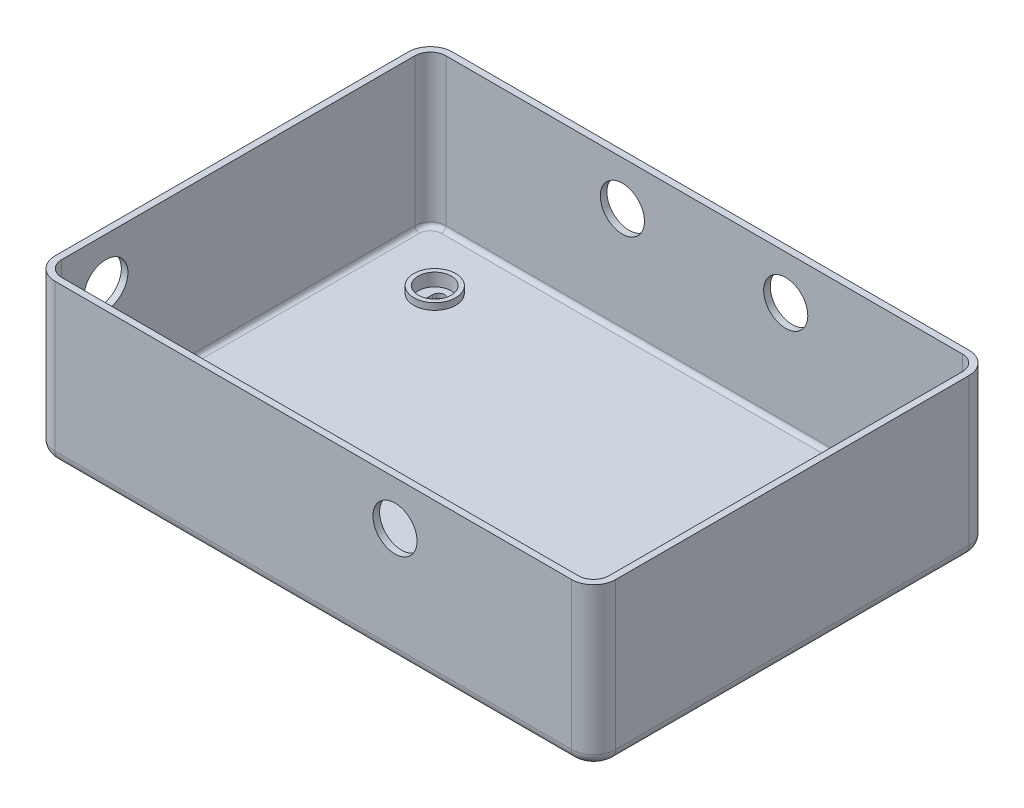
ISO-10303-21;
HEADER;
FILE_DESCRIPTION(('STEP AP214'),'2;1');
FILE_NAME('part.step','',(''),(''),'','','');
FILE_SCHEMA(('AUTOMOTIVE_DESIGN { 1 0 10303 214 1 1 1 1 }'));
ENDSEC;
DATA;
#1=APPLICATION_CONTEXT('core data for automotive mechanical design processes');
#2=APPLICATION_PROTOCOL_DEFINITION('international standard','automotive_design',2000,#1);
#3=PRODUCT_CONTEXT('',#1,'mechanical');
#4=PRODUCT('Part','Part','',(#3));
#5=PRODUCT_RELATED_PRODUCT_CATEGORY('part','',(#4));
#6=PRODUCT_DEFINITION_FORMATION('','',#4);
#7=PRODUCT_DEFINITION_CONTEXT('part definition',#1,'design');
#8=PRODUCT_DEFINITION('design','',#6,#7);
#9=PRODUCT_DEFINITION_SHAPE('','',#8);
#10=(LENGTH_UNIT() NAMED_UNIT(*) SI_UNIT(.MILLI.,.METRE.));
#11=(NAMED_UNIT(*) PLANE_ANGLE_UNIT() SI_UNIT($,.RADIAN.));
#12=(NAMED_UNIT(*) SI_UNIT($,.STERADIAN.) SOLID_ANGLE_UNIT());
#13=UNCERTAINTY_MEASURE_WITH_UNIT(LENGTH_MEASURE(1.E-05),#10,'distance_accuracy_value','');
#14=(GEOMETRIC_REPRESENTATION_CONTEXT(3) GLOBAL_UNCERTAINTY_ASSIGNED_CONTEXT((#13)) GLOBAL_UNIT_ASSIGNED_CONTEXT((#10,
#11,#12)) REPRESENTATION_CONTEXT('',''));
#15=CARTESIAN_POINT('',(0.,0.,0.));
#16=DIRECTION('',(0.,0.,1.));
#17=DIRECTION('',(1.,0.,0.));
#18=AXIS2_PLACEMENT_3D('',#15,#16,#17);
#19=CARTESIAN_POINT('',(95.,0.2,60.));
#20=DIRECTION('',(0.,1.,0.));
#21=DIRECTION('',(0.,0.,1.));
#22=AXIS2_PLACEMENT_3D('',#19,#20,#21);
#23=PLANE('',#22);
#24=CARTESIAN_POINT('',(95.,0.199999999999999,60.));
#25=DIRECTION('',(0.,1.,0.));
#26=DIRECTION('',(0.,0.,1.));
#27=AXIS2_PLACEMENT_3D('',#24,#25,#26);
#28=CIRCLE('',#27,7.5);
#29=CARTESIAN_POINT('',(95.,0.199999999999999,67.5));
#30=VERTEX_POINT('',#29);
#31=EDGE_CURVE('E541',#30,#30,#28,.F.);
#32=ORIENTED_EDGE('',*,*,#31,.F.);
#33=EDGE_LOOP('',(#32));
#34=FACE_BOUND('',#33,.T.);
#35=DIRECTION('',(1.,0.,0.));
#36=VECTOR('',#35,1.);
#37=CARTESIAN_POINT('',(96.75,0.200000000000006,57.25));
#38=LINE('',#37,#36);
#39=CARTESIAN_POINT('',(93.25,0.200000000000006,57.25));
#40=VERTEX_POINT('',#39);
#41=CARTESIAN_POINT('',(96.75,0.200000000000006,57.25));
#42=VERTEX_POINT('',#41);
#43=EDGE_CURVE('E435',#40,#42,#38,.T.);
#44=ORIENTED_EDGE('',*,*,#43,.T.);
#45=CARTESIAN_POINT('',(96.75,0.200000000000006,60.));
#46=DIRECTION('',(0.,1.,0.));
#47=DIRECTION('',(0.,0.,1.));
#48=AXIS2_PLACEMENT_3D('',#45,#46,#47);
#49=CIRCLE('',#48,2.74999999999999);
#50=CARTESIAN_POINT('',(96.75,0.200000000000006,62.75));
#51=VERTEX_POINT('',#50);
#52=EDGE_CURVE('E439',#42,#51,#49,.F.);
#53=ORIENTED_EDGE('',*,*,#52,.T.);
#54=DIRECTION('',(-1.,0.,0.));
#55=VECTOR('',#54,1.);
#56=CARTESIAN_POINT('',(96.75,0.200000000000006,62.75));
#57=LINE('',#56,#55);
#58=CARTESIAN_POINT('',(93.25,0.200000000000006,62.75));
#59=VERTEX_POINT('',#58);
#60=EDGE_CURVE('E402',#51,#59,#57,.T.);
#61=ORIENTED_EDGE('',*,*,#60,.T.);
#62=CARTESIAN_POINT('',(93.25,0.200000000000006,60.));
#63=DIRECTION('',(0.,1.,0.));
#64=DIRECTION('',(0.,0.,1.));
#65=AXIS2_PLACEMENT_3D('',#62,#63,#64);
#66=CIRCLE('',#65,2.74999999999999);
#67=EDGE_CURVE('E431',#59,#40,#66,.F.);
#68=ORIENTED_EDGE('',*,*,#67,.T.);
#69=EDGE_LOOP('',(#44,#53,#61,#68));
#70=FACE_BOUND('',#69,.T.);
#71=ADVANCED_FACE('F49',(#34,#70),#23,.T.);
#72=CARTESIAN_POINT('',(95.,0.2,60.));
#73=DIRECTION('',(0.,1.,0.));
#74=DIRECTION('',(0.,0.,1.));
#75=AXIS2_PLACEMENT_3D('',#72,#73,#74);
#76=PLANE('',#75);
#77=CARTESIAN_POINT('',(-95.,0.199999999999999,-60.));
#78=DIRECTION('',(0.,1.,0.));
#79=DIRECTION('',(0.,0.,1.));
#80=AXIS2_PLACEMENT_3D('',#77,#78,#79);
#81=CIRCLE('',#80,7.5);
#82=CARTESIAN_POINT('',(-95.,0.199999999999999,-52.5));
#83=VERTEX_POINT('',#82);
#84=EDGE_CURVE('E529',#83,#83,#81,.F.);
#85=ORIENTED_EDGE('',*,*,#84,.F.);
#86=EDGE_LOOP('',(#85));
#87=FACE_BOUND('',#86,.T.);
#88=DIRECTION('',(0.,0.,-1.));
#89=VECTOR('',#88,1.);
#90=CARTESIAN_POINT('',(-97.7499999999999,0.200000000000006,-61.75));
#91=LINE('',#90,#89);
#92=CARTESIAN_POINT('',(-97.7499999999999,0.200000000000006,-58.25));
#93=VERTEX_POINT('',#92);
#94=CARTESIAN_POINT('',(-97.7499999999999,0.200000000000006,-61.75));
#95=VERTEX_POINT('',#94);
#96=EDGE_CURVE('E370',#93,#95,#91,.T.);
#97=ORIENTED_EDGE('',*,*,#96,.T.);
#98=CARTESIAN_POINT('',(-94.9999999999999,0.200000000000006,-61.75));
#99=DIRECTION('',(0.,1.,0.));
#100=DIRECTION('',(0.,0.,1.));
#101=AXIS2_PLACEMENT_3D('',#98,#99,#100);
#102=CIRCLE('',#101,2.75);
#103=CARTESIAN_POINT('',(-92.2499999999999,0.200000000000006,-61.75));
#104=VERTEX_POINT('',#103);
#105=EDGE_CURVE('E361',#95,#104,#102,.F.);
#106=ORIENTED_EDGE('',*,*,#105,.T.);
#107=DIRECTION('',(0.,0.,1.));
#108=VECTOR('',#107,1.);
#109=CARTESIAN_POINT('',(-92.2499999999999,0.200000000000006,-61.75));
#110=LINE('',#109,#108);
#111=CARTESIAN_POINT('',(-92.2499999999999,0.200000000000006,-58.25));
#112=VERTEX_POINT('',#111);
#113=EDGE_CURVE('E347',#104,#112,#110,.T.);
#114=ORIENTED_EDGE('',*,*,#113,.T.);
#115=CARTESIAN_POINT('',(-94.9999999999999,0.200000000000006,-58.25));
#116=DIRECTION('',(0.,1.,0.));
#117=DIRECTION('',(0.,0.,1.));
#118=AXIS2_PLACEMENT_3D('',#115,#116,#117);
#119=CIRCLE('',#118,2.75);
#120=EDGE_CURVE('E378',#112,#93,#119,.F.);
#121=ORIENTED_EDGE('',*,*,#120,.T.);
#122=EDGE_LOOP('',(#97,#106,#114,#121));
#123=FACE_BOUND('',#122,.T.);
#124=ADVANCED_FACE('F369',(#87,#123),#76,.T.);
#125=CARTESIAN_POINT('',(95.,0.2,60.));
#126=DIRECTION('',(0.,1.,0.));
#127=DIRECTION('',(0.,0.,1.));
#128=AXIS2_PLACEMENT_3D('',#125,#126,#127);
#129=PLANE('',#128);
#130=CARTESIAN_POINT('',(95.,0.199999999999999,-60.));
#131=DIRECTION('',(0.,1.,0.));
#132=DIRECTION('',(0.,0.,1.));
#133=AXIS2_PLACEMENT_3D('',#130,#131,#132);
#134=CIRCLE('',#133,7.5);
#135=CARTESIAN_POINT('',(95.,0.199999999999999,-52.5));
#136=VERTEX_POINT('',#135);
#137=EDGE_CURVE('E521',#136,#136,#134,.F.);
#138=ORIENTED_EDGE('',*,*,#137,.F.);
#139=EDGE_LOOP('',(#138));
#140=FACE_BOUND('',#139,.T.);
#141=DIRECTION('',(-1.,0.,0.));
#142=VECTOR('',#141,1.);
#143=CARTESIAN_POINT('',(93.2499999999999,0.200000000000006,-57.25));
#144=LINE('',#143,#142);
#145=CARTESIAN_POINT('',(96.7499999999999,0.200000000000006,-57.25));
#146=VERTEX_POINT('',#145);
#147=CARTESIAN_POINT('',(93.2499999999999,0.200000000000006,-57.25));
#148=VERTEX_POINT('',#147);
#149=EDGE_CURVE('E401',#146,#148,#144,.T.);
#150=ORIENTED_EDGE('',*,*,#149,.T.);
#151=CARTESIAN_POINT('',(93.2499999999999,0.200000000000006,-60.));
#152=DIRECTION('',(0.,1.,0.));
#153=DIRECTION('',(0.,0.,1.));
#154=AXIS2_PLACEMENT_3D('',#151,#152,#153);
#155=CIRCLE('',#154,2.75000000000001);
#156=CARTESIAN_POINT('',(93.2499999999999,0.200000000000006,-62.75));
#157=VERTEX_POINT('',#156);
#158=EDGE_CURVE('E405',#148,#157,#155,.F.);
#159=ORIENTED_EDGE('',*,*,#158,.T.);
#160=DIRECTION('',(1.,0.,0.));
#161=VECTOR('',#160,1.);
#162=CARTESIAN_POINT('',(93.2499999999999,0.200000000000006,-62.75));
#163=LINE('',#162,#161);
#164=CARTESIAN_POINT('',(96.7499999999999,0.200000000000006,-62.75));
#165=VERTEX_POINT('',#164);
#166=EDGE_CURVE('E422',#157,#165,#163,.T.);
#167=ORIENTED_EDGE('',*,*,#166,.T.);
#168=CARTESIAN_POINT('',(96.7499999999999,0.200000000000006,-60.));
#169=DIRECTION('',(0.,1.,0.));
#170=DIRECTION('',(0.,0.,1.));
#171=AXIS2_PLACEMENT_3D('',#168,#169,#170);
#172=CIRCLE('',#171,2.75000000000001);
#173=EDGE_CURVE('E398',#165,#146,#172,.F.);
#174=ORIENTED_EDGE('',*,*,#173,.T.);
#175=EDGE_LOOP('',(#150,#159,#167,#174));
#176=FACE_BOUND('',#175,.T.);
#177=ADVANCED_FACE('F899',(#140,#176),#129,.T.);
#178=CARTESIAN_POINT('',(95.,0.2,60.));
#179=DIRECTION('',(0.,1.,0.));
#180=DIRECTION('',(0.,0.,1.));
#181=AXIS2_PLACEMENT_3D('',#178,#179,#180);
#182=PLANE('',#181);
#183=CARTESIAN_POINT('',(-95.,0.199999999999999,60.));
#184=DIRECTION('',(0.,1.,0.));
#185=DIRECTION('',(0.,0.,1.));
#186=AXIS2_PLACEMENT_3D('',#183,#184,#185);
#187=CIRCLE('',#186,7.5);
#188=CARTESIAN_POINT('',(-95.,0.199999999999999,67.5));
#189=VERTEX_POINT('',#188);
#190=EDGE_CURVE('E520',#189,#189,#187,.F.);
#191=ORIENTED_EDGE('',*,*,#190,.F.);
#192=EDGE_LOOP('',(#191));
#193=FACE_BOUND('',#192,.T.);
#194=DIRECTION('',(0.,0.,-1.));
#195=VECTOR('',#194,1.);
#196=CARTESIAN_POINT('',(-97.75,0.200000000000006,58.25));
#197=LINE('',#196,#195);
#198=CARTESIAN_POINT('',(-97.75,0.200000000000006,61.75));
#199=VERTEX_POINT('',#198);
#200=CARTESIAN_POINT('',(-97.75,0.200000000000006,58.25));
#201=VERTEX_POINT('',#200);
#202=EDGE_CURVE('E475',#199,#201,#197,.T.);
#203=ORIENTED_EDGE('',*,*,#202,.T.);
#204=CARTESIAN_POINT('',(-95.,0.200000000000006,58.25));
#205=DIRECTION('',(0.,1.,0.));
#206=DIRECTION('',(0.,0.,1.));
#207=AXIS2_PLACEMENT_3D('',#204,#205,#206);
#208=CIRCLE('',#207,2.75000000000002);
#209=CARTESIAN_POINT('',(-92.25,0.200000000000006,58.25));
#210=VERTEX_POINT('',#209);
#211=EDGE_CURVE('E479',#201,#210,#208,.F.);
#212=ORIENTED_EDGE('',*,*,#211,.T.);
#213=DIRECTION('',(0.,0.,1.));
#214=VECTOR('',#213,1.);
#215=CARTESIAN_POINT('',(-92.25,0.200000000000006,58.25));
#216=LINE('',#215,#214);
#217=CARTESIAN_POINT('',(-92.25,0.200000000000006,61.75));
#218=VERTEX_POINT('',#217);
#219=EDGE_CURVE('E502',#210,#218,#216,.T.);
#220=ORIENTED_EDGE('',*,*,#219,.T.);
#221=CARTESIAN_POINT('',(-95.,0.200000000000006,61.75));
#222=DIRECTION('',(0.,1.,0.));
#223=DIRECTION('',(0.,0.,1.));
#224=AXIS2_PLACEMENT_3D('',#221,#222,#223);
#225=CIRCLE('',#224,2.75000000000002);
#226=EDGE_CURVE('E356',#218,#199,#225,.F.);
#227=ORIENTED_EDGE('',*,*,#226,.T.);
#228=EDGE_LOOP('',(#203,#212,#220,#227));
#229=FACE_BOUND('',#228,.T.);
#230=ADVANCED_FACE('F1017',(#193,#229),#182,.T.);
#231=CARTESIAN_POINT('',(-127.,71.7,90.));
#232=DIRECTION('',(1.,0.,0.));
#233=DIRECTION('',(0.,0.,-1.));
#234=AXIS2_PLACEMENT_3D('',#231,#232,#233);
#235=PLANE('',#234);
#236=CARTESIAN_POINT('',(-127.,51.7,60.));
#237=DIRECTION('',(-1.,0.,0.));
#238=DIRECTION('',(0.,0.,1.));
#239=AXIS2_PLACEMENT_3D('',#236,#237,#238);
#240=CIRCLE('',#239,9.99999999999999);
#241=CARTESIAN_POINT('',(-127.,51.7,70.));
#242=VERTEX_POINT('',#241);
#243=EDGE_CURVE('E616',#242,#242,#240,.T.);
#244=ORIENTED_EDGE('',*,*,#243,.F.);
#245=EDGE_LOOP('',(#244));
#246=FACE_BOUND('',#245,.T.);
#247=DIRECTION('',(0.,-1.,0.));
#248=VECTOR('',#247,1.);
#249=CARTESIAN_POINT('',(-127.,71.7,-80.));
#250=LINE('',#249,#248);
#251=CARTESIAN_POINT('',(-127.,71.7,-80.));
#252=VERTEX_POINT('',#251);
#253=CARTESIAN_POINT('',(-127.,5.,-80.));
#254=VERTEX_POINT('',#253);
#255=EDGE_CURVE('E762',#252,#254,#250,.T.);
#256=ORIENTED_EDGE('',*,*,#255,.T.);
#257=DIRECTION('',(0.,0.,1.));
#258=VECTOR('',#257,1.);
#259=CARTESIAN_POINT('',(-127.,5.,90.));
#260=LINE('',#259,#258);
#261=CARTESIAN_POINT('',(-127.,5.,80.));
#262=VERTEX_POINT('',#261);
#263=EDGE_CURVE('E819',#254,#262,#260,.T.);
#264=ORIENTED_EDGE('',*,*,#263,.T.);
#265=DIRECTION('',(0.,-1.,0.));
#266=VECTOR('',#265,1.);
#267=CARTESIAN_POINT('',(-127.,71.7,80.));
#268=LINE('',#267,#266);
#269=CARTESIAN_POINT('',(-127.,71.7,80.));
#270=VERTEX_POINT('',#269);
#271=EDGE_CURVE('E759',#262,#270,#268,.F.);
#272=ORIENTED_EDGE('',*,*,#271,.T.);
#273=DIRECTION('',(0.,0.,1.));
#274=VECTOR('',#273,1.);
#275=CARTESIAN_POINT('',(-127.,71.7,90.));
#276=LINE('',#275,#274);
#277=EDGE_CURVE('E742',#252,#270,#276,.T.);
#278=ORIENTED_EDGE('',*,*,#277,.F.);
#279=EDGE_LOOP('',(#256,#264,#272,#278));
#280=FACE_BOUND('',#279,.T.);
#281=ADVANCED_FACE('F1013',(#246,#280),#235,.F.);
#282=CARTESIAN_POINT('',(127.,71.7,90.));
#283=DIRECTION('',(0.,0.,-1.));
#284=DIRECTION('',(-1.,0.,0.));
#285=AXIS2_PLACEMENT_3D('',#282,#283,#284);
#286=PLANE('',#285);
#287=CARTESIAN_POINT('',(37.,51.7,90.));
#288=DIRECTION('',(0.,0.,1.));
#289=DIRECTION('',(1.,0.,0.));
#290=AXIS2_PLACEMENT_3D('',#287,#288,#289);
#291=CIRCLE('',#290,10.);
#292=CARTESIAN_POINT('',(47.,51.7,90.));
#293=VERTEX_POINT('',#292);
#294=EDGE_CURVE('E588',#293,#293,#291,.T.);
#295=ORIENTED_EDGE('',*,*,#294,.F.);
#296=EDGE_LOOP('',(#295));
#297=FACE_BOUND('',#296,.T.);
#298=DIRECTION('',(0.,-1.,0.));
#299=VECTOR('',#298,1.);
#300=CARTESIAN_POINT('',(-117.,71.7,90.));
#301=LINE('',#300,#299);
#302=CARTESIAN_POINT('',(-117.,71.7,90.));
#303=VERTEX_POINT('',#302);
#304=CARTESIAN_POINT('',(-117.,5.,90.));
#305=VERTEX_POINT('',#304);
#306=EDGE_CURVE('E785',#303,#305,#301,.T.);
#307=ORIENTED_EDGE('',*,*,#306,.T.);
#308=DIRECTION('',(1.,0.,0.));
#309=VECTOR('',#308,1.);
#310=CARTESIAN_POINT('',(127.,5.,90.));
#311=LINE('',#310,#309);
#312=CARTESIAN_POINT('',(117.,5.,90.));
#313=VERTEX_POINT('',#312);
#314=EDGE_CURVE('E587',#305,#313,#311,.T.);
#315=ORIENTED_EDGE('',*,*,#314,.T.);
#316=DIRECTION('',(0.,-1.,0.));
#317=VECTOR('',#316,1.);
#318=CARTESIAN_POINT('',(117.,71.7,90.));
#319=LINE('',#318,#317);
#320=CARTESIAN_POINT('',(117.,71.7,90.));
#321=VERTEX_POINT('',#320);
#322=EDGE_CURVE('E789',#313,#321,#319,.F.);
#323=ORIENTED_EDGE('',*,*,#322,.T.);
#324=DIRECTION('',(1.,0.,0.));
#325=VECTOR('',#324,1.);
#326=CARTESIAN_POINT('',(127.,71.7,90.));
#327=LINE('',#326,#325);
#328=EDGE_CURVE('E746',#303,#321,#327,.T.);
#329=ORIENTED_EDGE('',*,*,#328,.F.);
#330=EDGE_LOOP('',(#307,#315,#323,#329));
#331=FACE_BOUND('',#330,.T.);
#332=ADVANCED_FACE('F1009',(#297,#331),#286,.F.);
#333=CARTESIAN_POINT('',(127.,71.7,90.));
#334=DIRECTION('',(-1.,0.,0.));
#335=DIRECTION('',(0.,0.,1.));
#336=AXIS2_PLACEMENT_3D('',#333,#334,#335);
#337=PLANE('',#336);
#338=DIRECTION('',(0.,-1.,0.));
#339=VECTOR('',#338,1.);
#340=CARTESIAN_POINT('',(127.,71.7,80.));
#341=LINE('',#340,#339);
#342=CARTESIAN_POINT('',(127.,71.7,80.));
#343=VERTEX_POINT('',#342);
#344=CARTESIAN_POINT('',(127.,5.,80.));
#345=VERTEX_POINT('',#344);
#346=EDGE_CURVE('E780',#343,#345,#341,.T.);
#347=ORIENTED_EDGE('',*,*,#346,.T.);
#348=DIRECTION('',(0.,0.,-1.));
#349=VECTOR('',#348,1.);
#350=CARTESIAN_POINT('',(127.,5.,90.));
#351=LINE('',#350,#349);
#352=CARTESIAN_POINT('',(127.,5.,-80.));
#353=VERTEX_POINT('',#352);
#354=EDGE_CURVE('E829',#345,#353,#351,.T.);
#355=ORIENTED_EDGE('',*,*,#354,.T.);
#356=DIRECTION('',(0.,-1.,0.));
#357=VECTOR('',#356,1.);
#358=CARTESIAN_POINT('',(127.,71.7,-80.));
#359=LINE('',#358,#357);
#360=CARTESIAN_POINT('',(127.,71.7,-80.));
#361=VERTEX_POINT('',#360);
#362=EDGE_CURVE('E783',#353,#361,#359,.F.);
#363=ORIENTED_EDGE('',*,*,#362,.T.);
#364=DIRECTION('',(0.,0.,-1.));
#365=VECTOR('',#364,1.);
#366=CARTESIAN_POINT('',(127.,71.7,90.));
#367=LINE('',#366,#365);
#368=EDGE_CURVE('E751',#343,#361,#367,.T.);
#369=ORIENTED_EDGE('',*,*,#368,.F.);
#370=EDGE_LOOP('',(#347,#355,#363,#369));
#371=FACE_BOUND('',#370,.T.);
#372=ADVANCED_FACE('F1005',(#371),#337,.F.);
#373=CARTESIAN_POINT('',(127.,71.7,-90.));
#374=DIRECTION('',(0.,0.,1.));
#375=DIRECTION('',(1.,0.,0.));
#376=AXIS2_PLACEMENT_3D('',#373,#374,#375);
#377=PLANE('',#376);
#378=CARTESIAN_POINT('',(-37.,51.7,-90.));
#379=DIRECTION('',(0.,0.,-1.));
#380=DIRECTION('',(-1.,0.,0.));
#381=AXIS2_PLACEMENT_3D('',#378,#379,#380);
#382=CIRCLE('',#381,9.99999999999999);
#383=CARTESIAN_POINT('',(-47.,51.7,-90.));
#384=VERTEX_POINT('',#383);
#385=EDGE_CURVE('E597',#384,#384,#382,.T.);
#386=ORIENTED_EDGE('',*,*,#385,.F.);
#387=EDGE_LOOP('',(#386));
#388=FACE_BOUND('',#387,.T.);
#389=CARTESIAN_POINT('',(37.,51.7,-90.));
#390=DIRECTION('',(0.,0.,-1.));
#391=DIRECTION('',(-1.,0.,0.));
#392=AXIS2_PLACEMENT_3D('',#389,#390,#391);
#393=CIRCLE('',#392,9.99999999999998);
#394=CARTESIAN_POINT('',(27.,51.7,-90.));
#395=VERTEX_POINT('',#394);
#396=EDGE_CURVE('E606',#395,#395,#393,.T.);
#397=ORIENTED_EDGE('',*,*,#396,.F.);
#398=EDGE_LOOP('',(#397));
#399=FACE_BOUND('',#398,.T.);
#400=DIRECTION('',(0.,-1.,0.));
#401=VECTOR('',#400,1.);
#402=CARTESIAN_POINT('',(117.,71.7,-90.));
#403=LINE('',#402,#401);
#404=CARTESIAN_POINT('',(117.,71.7,-90.));
#405=VERTEX_POINT('',#404);
#406=CARTESIAN_POINT('',(117.,5.,-90.));
#407=VERTEX_POINT('',#406);
#408=EDGE_CURVE('E765',#405,#407,#403,.T.);
#409=ORIENTED_EDGE('',*,*,#408,.T.);
#410=DIRECTION('',(-1.,0.,0.));
#411=VECTOR('',#410,1.);
#412=CARTESIAN_POINT('',(127.,5.,-90.));
#413=LINE('',#412,#411);
#414=CARTESIAN_POINT('',(-117.,5.,-90.));
#415=VERTEX_POINT('',#414);
#416=EDGE_CURVE('E824',#407,#415,#413,.T.);
#417=ORIENTED_EDGE('',*,*,#416,.T.);
#418=DIRECTION('',(0.,-1.,0.));
#419=VECTOR('',#418,1.);
#420=CARTESIAN_POINT('',(-117.,71.7,-90.));
#421=LINE('',#420,#419);
#422=CARTESIAN_POINT('',(-117.,71.7,-90.));
#423=VERTEX_POINT('',#422);
#424=EDGE_CURVE('E768',#415,#423,#421,.F.);
#425=ORIENTED_EDGE('',*,*,#424,.T.);
#426=DIRECTION('',(-1.,0.,0.));
#427=VECTOR('',#426,1.);
#428=CARTESIAN_POINT('',(127.,71.7,-90.));
#429=LINE('',#428,#427);
#430=EDGE_CURVE('E755',#405,#423,#429,.T.);
#431=ORIENTED_EDGE('',*,*,#430,.F.);
#432=EDGE_LOOP('',(#409,#417,#425,#431));
#433=FACE_BOUND('',#432,.T.);
#434=ADVANCED_FACE('F998',(#388,#399,#433),#377,.F.);
#435=CARTESIAN_POINT('',(0.,71.7,0.));
#436=DIRECTION('',(0.,1.,0.));
#437=DIRECTION('',(0.,0.,1.));
#438=AXIS2_PLACEMENT_3D('',#435,#436,#437);
#439=PLANE('',#438);
#440=DIRECTION('',(-1.,0.,0.));
#441=VECTOR('',#440,1.);
#442=CARTESIAN_POINT('',(127.,71.7,-87.));
#443=LINE('',#442,#441);
#444=CARTESIAN_POINT('',(117.,71.7,-87.));
#445=VERTEX_POINT('',#444);
#446=CARTESIAN_POINT('',(-117.,71.7,-87.));
#447=VERTEX_POINT('',#446);
#448=EDGE_CURVE('E634',#445,#447,#443,.T.);
#449=ORIENTED_EDGE('',*,*,#448,.F.);
#450=CARTESIAN_POINT('',(117.,71.7,-80.));
#451=DIRECTION('',(0.,1.,0.));
#452=DIRECTION('',(0.,0.,1.));
#453=AXIS2_PLACEMENT_3D('',#450,#451,#452);
#454=CIRCLE('',#453,7.);
#455=CARTESIAN_POINT('',(124.,71.7,-80.));
#456=VERTEX_POINT('',#455);
#457=EDGE_CURVE('E733',#456,#445,#454,.T.);
#458=ORIENTED_EDGE('',*,*,#457,.F.);
#459=DIRECTION('',(0.,0.,-1.));
#460=VECTOR('',#459,1.);
#461=CARTESIAN_POINT('',(124.,71.7,90.));
#462=LINE('',#461,#460);
#463=CARTESIAN_POINT('',(124.,71.7,80.));
#464=VERTEX_POINT('',#463);
#465=EDGE_CURVE('E731',#464,#456,#462,.T.);
#466=ORIENTED_EDGE('',*,*,#465,.F.);
#467=CARTESIAN_POINT('',(117.,71.7,80.));
#468=DIRECTION('',(0.,1.,0.));
#469=DIRECTION('',(0.,0.,1.));
#470=AXIS2_PLACEMENT_3D('',#467,#468,#469);
#471=CIRCLE('',#470,7.);
#472=CARTESIAN_POINT('',(117.,71.7,87.));
#473=VERTEX_POINT('',#472);
#474=EDGE_CURVE('E727',#473,#464,#471,.T.);
#475=ORIENTED_EDGE('',*,*,#474,.F.);
#476=DIRECTION('',(1.,0.,0.));
#477=VECTOR('',#476,1.);
#478=CARTESIAN_POINT('',(127.,71.7,87.));
#479=LINE('',#478,#477);
#480=CARTESIAN_POINT('',(-117.,71.7,87.));
#481=VERTEX_POINT('',#480);
#482=EDGE_CURVE('E725',#481,#473,#479,.T.);
#483=ORIENTED_EDGE('',*,*,#482,.F.);
#484=CARTESIAN_POINT('',(-117.,71.7,80.));
#485=DIRECTION('',(0.,1.,0.));
#486=DIRECTION('',(0.,0.,1.));
#487=AXIS2_PLACEMENT_3D('',#484,#485,#486);
#488=CIRCLE('',#487,7.);
#489=CARTESIAN_POINT('',(-124.,71.7,80.));
#490=VERTEX_POINT('',#489);
#491=EDGE_CURVE('E638',#490,#481,#488,.T.);
#492=ORIENTED_EDGE('',*,*,#491,.F.);
#493=DIRECTION('',(0.,0.,1.));
#494=VECTOR('',#493,1.);
#495=CARTESIAN_POINT('',(-124.,71.7,90.));
#496=LINE('',#495,#494);
#497=CARTESIAN_POINT('',(-124.,71.7,-80.));
#498=VERTEX_POINT('',#497);
#499=EDGE_CURVE('E713',#498,#490,#496,.T.);
#500=ORIENTED_EDGE('',*,*,#499,.F.);
#501=CARTESIAN_POINT('',(-117.,71.7,-80.));
#502=DIRECTION('',(0.,1.,0.));
#503=DIRECTION('',(0.,0.,1.));
#504=AXIS2_PLACEMENT_3D('',#501,#502,#503);
#505=CIRCLE('',#504,7.);
#506=EDGE_CURVE('E655',#447,#498,#505,.T.);
#507=ORIENTED_EDGE('',*,*,#506,.F.);
#508=EDGE_LOOP('',(#449,#458,#466,#475,#483,#492,#500,#507));
#509=FACE_BOUND('',#508,.T.);
#510=ORIENTED_EDGE('',*,*,#430,.T.);
#511=CARTESIAN_POINT('',(-117.,71.7,-80.));
#512=DIRECTION('',(0.,1.,0.));
#513=DIRECTION('',(0.,0.,1.));
#514=AXIS2_PLACEMENT_3D('',#511,#512,#513);
#515=CIRCLE('',#514,10.);
#516=EDGE_CURVE('E777',#423,#252,#515,.T.);
#517=ORIENTED_EDGE('',*,*,#516,.T.);
#518=ORIENTED_EDGE('',*,*,#277,.T.);
#519=CARTESIAN_POINT('',(-117.,71.7,80.));
#520=DIRECTION('',(0.,1.,0.));
#521=DIRECTION('',(0.,0.,1.));
#522=AXIS2_PLACEMENT_3D('',#519,#520,#521);
#523=CIRCLE('',#522,10.);
#524=EDGE_CURVE('E771',#270,#303,#523,.T.);
#525=ORIENTED_EDGE('',*,*,#524,.T.);
#526=ORIENTED_EDGE('',*,*,#328,.T.);
#527=CARTESIAN_POINT('',(117.,71.7,80.));
#528=DIRECTION('',(0.,1.,0.));
#529=DIRECTION('',(0.,0.,1.));
#530=AXIS2_PLACEMENT_3D('',#527,#528,#529);
#531=CIRCLE('',#530,10.);
#532=EDGE_CURVE('E773',#321,#343,#531,.T.);
#533=ORIENTED_EDGE('',*,*,#532,.T.);
#534=ORIENTED_EDGE('',*,*,#368,.T.);
#535=CARTESIAN_POINT('',(117.,71.7,-80.));
#536=DIRECTION('',(0.,1.,0.));
#537=DIRECTION('',(0.,0.,1.));
#538=AXIS2_PLACEMENT_3D('',#535,#536,#537);
#539=CIRCLE('',#538,10.);
#540=EDGE_CURVE('E775',#361,#405,#539,.T.);
#541=ORIENTED_EDGE('',*,*,#540,.T.);
#542=EDGE_LOOP('',(#510,#517,#518,#525,#526,#533,#534,#541));
#543=FACE_BOUND('',#542,.T.);
#544=ADVANCED_FACE('F994',(#509,#543),#439,.T.);
#545=CARTESIAN_POINT('',(0.,0.,0.));
#546=DIRECTION('',(0.,1.,0.));
#547=DIRECTION('',(0.,0.,1.));
#548=AXIS2_PLACEMENT_3D('',#545,#546,#547);
#549=PLANE('',#548);
#550=CARTESIAN_POINT('',(-94.9999999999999,0.,-60.));
#551=DIRECTION('',(0.,1.,0.));
#552=DIRECTION('',(0.,0.,1.));
#553=AXIS2_PLACEMENT_3D('',#550,#551,#552);
#554=CIRCLE('',#553,9.49999999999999);
#555=CARTESIAN_POINT('',(-94.9999999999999,0.,-50.5));
#556=VERTEX_POINT('',#555);
#557=EDGE_CURVE('E12',#556,#556,#554,.F.);
#558=ORIENTED_EDGE('',*,*,#557,.F.);
#559=EDGE_LOOP('',(#558));
#560=FACE_BOUND('',#559,.T.);
#561=CARTESIAN_POINT('',(94.9999999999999,0.,-60.));
#562=DIRECTION('',(0.,1.,0.));
#563=DIRECTION('',(0.,0.,1.));
#564=AXIS2_PLACEMENT_3D('',#561,#562,#563);
#565=CIRCLE('',#564,9.49999999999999);
#566=CARTESIAN_POINT('',(94.9999999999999,0.,-50.5));
#567=VERTEX_POINT('',#566);
#568=EDGE_CURVE('E59',#567,#567,#565,.F.);
#569=ORIENTED_EDGE('',*,*,#568,.F.);
#570=EDGE_LOOP('',(#569));
#571=FACE_BOUND('',#570,.T.);
#572=CARTESIAN_POINT('',(95.,0.,60.));
#573=DIRECTION('',(0.,1.,0.));
#574=DIRECTION('',(0.,0.,1.));
#575=AXIS2_PLACEMENT_3D('',#572,#573,#574);
#576=CIRCLE('',#575,9.49999999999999);
#577=CARTESIAN_POINT('',(95.,0.,69.5));
#578=VERTEX_POINT('',#577);
#579=EDGE_CURVE('E561',#578,#578,#576,.F.);
#580=ORIENTED_EDGE('',*,*,#579,.F.);
#581=EDGE_LOOP('',(#580));
#582=FACE_BOUND('',#581,.T.);
#583=CARTESIAN_POINT('',(-95.,0.,60.));
#584=DIRECTION('',(0.,1.,0.));
#585=DIRECTION('',(0.,0.,1.));
#586=AXIS2_PLACEMENT_3D('',#583,#584,#585);
#587=CIRCLE('',#586,9.49999999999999);
#588=CARTESIAN_POINT('',(-95.,0.,69.5));
#589=VERTEX_POINT('',#588);
#590=EDGE_CURVE('E574',#589,#589,#587,.F.);
#591=ORIENTED_EDGE('',*,*,#590,.F.);
#592=EDGE_LOOP('',(#591));
#593=FACE_BOUND('',#592,.T.);
#594=DIRECTION('',(1.,0.,0.));
#595=VECTOR('',#594,1.);
#596=CARTESIAN_POINT('',(0.,0.,85.));
#597=LINE('',#596,#595);
#598=CARTESIAN_POINT('',(117.,0.,85.));
#599=VERTEX_POINT('',#598);
#600=CARTESIAN_POINT('',(-117.,0.,85.));
#601=VERTEX_POINT('',#600);
#602=EDGE_CURVE('E792',#599,#601,#597,.F.);
#603=ORIENTED_EDGE('',*,*,#602,.T.);
#604=CARTESIAN_POINT('',(-117.,0.,80.));
#605=DIRECTION('',(0.,1.,0.));
#606=DIRECTION('',(0.,0.,1.));
#607=AXIS2_PLACEMENT_3D('',#604,#605,#606);
#608=CIRCLE('',#607,5.);
#609=CARTESIAN_POINT('',(-122.,0.,80.));
#610=VERTEX_POINT('',#609);
#611=EDGE_CURVE('E811',#601,#610,#608,.F.);
#612=ORIENTED_EDGE('',*,*,#611,.T.);
#613=DIRECTION('',(0.,0.,1.));
#614=VECTOR('',#613,1.);
#615=CARTESIAN_POINT('',(-122.,0.,0.));
#616=LINE('',#615,#614);
#617=CARTESIAN_POINT('',(-122.,0.,-80.));
#618=VERTEX_POINT('',#617);
#619=EDGE_CURVE('E808',#610,#618,#616,.F.);
#620=ORIENTED_EDGE('',*,*,#619,.T.);
#621=CARTESIAN_POINT('',(-117.,0.,-80.));
#622=DIRECTION('',(0.,1.,0.));
#623=DIRECTION('',(0.,0.,1.));
#624=AXIS2_PLACEMENT_3D('',#621,#622,#623);
#625=CIRCLE('',#624,5.);
#626=CARTESIAN_POINT('',(-117.,0.,-85.));
#627=VERTEX_POINT('',#626);
#628=EDGE_CURVE('E806',#618,#627,#625,.F.);
#629=ORIENTED_EDGE('',*,*,#628,.T.);
#630=DIRECTION('',(-1.,0.,0.));
#631=VECTOR('',#630,1.);
#632=CARTESIAN_POINT('',(0.,0.,-85.));
#633=LINE('',#632,#631);
#634=CARTESIAN_POINT('',(117.,0.,-85.));
#635=VERTEX_POINT('',#634);
#636=EDGE_CURVE('E803',#627,#635,#633,.F.);
#637=ORIENTED_EDGE('',*,*,#636,.T.);
#638=CARTESIAN_POINT('',(117.,0.,-80.));
#639=DIRECTION('',(0.,1.,0.));
#640=DIRECTION('',(0.,0.,1.));
#641=AXIS2_PLACEMENT_3D('',#638,#639,#640);
#642=CIRCLE('',#641,5.);
#643=CARTESIAN_POINT('',(122.,0.,-80.));
#644=VERTEX_POINT('',#643);
#645=EDGE_CURVE('E801',#635,#644,#642,.F.);
#646=ORIENTED_EDGE('',*,*,#645,.T.);
#647=DIRECTION('',(0.,0.,-1.));
#648=VECTOR('',#647,1.);
#649=CARTESIAN_POINT('',(122.,0.,0.));
#650=LINE('',#649,#648);
#651=CARTESIAN_POINT('',(122.,0.,80.));
#652=VERTEX_POINT('',#651);
#653=EDGE_CURVE('E798',#644,#652,#650,.F.);
#654=ORIENTED_EDGE('',*,*,#653,.T.);
#655=CARTESIAN_POINT('',(117.,0.,80.));
#656=DIRECTION('',(0.,1.,0.));
#657=DIRECTION('',(0.,0.,1.));
#658=AXIS2_PLACEMENT_3D('',#655,#656,#657);
#659=CIRCLE('',#658,5.);
#660=EDGE_CURVE('E795',#652,#599,#659,.F.);
#661=ORIENTED_EDGE('',*,*,#660,.T.);
#662=EDGE_LOOP('',(#603,#612,#620,#629,#637,#646,#654,#661));
#663=FACE_BOUND('',#662,.T.);
#664=ADVANCED_FACE('F997',(#560,#571,#582,#593,#663),#549,.F.);
#665=CARTESIAN_POINT('',(-117.,71.7,-80.));
#666=DIRECTION('',(0.,-1.,0.));
#667=DIRECTION('',(0.,0.,-1.));
#668=AXIS2_PLACEMENT_3D('',#665,#666,#667);
#669=CYLINDRICAL_SURFACE('',#668,10.);
#670=ORIENTED_EDGE('',*,*,#424,.F.);
#671=CARTESIAN_POINT('',(-117.,5.,-80.));
#672=DIRECTION('',(0.,1.,0.));
#673=DIRECTION('',(0.,0.,1.));
#674=AXIS2_PLACEMENT_3D('',#671,#672,#673);
#675=CIRCLE('',#674,10.);
#676=EDGE_CURVE('E822',#415,#254,#675,.T.);
#677=ORIENTED_EDGE('',*,*,#676,.T.);
#678=ORIENTED_EDGE('',*,*,#255,.F.);
#679=ORIENTED_EDGE('',*,*,#516,.F.);
#680=EDGE_LOOP('',(#670,#677,#678,#679));
#681=FACE_BOUND('',#680,.T.);
#682=ADVANCED_FACE('F1001',(#681),#669,.T.);
#683=CARTESIAN_POINT('',(117.,71.7,-80.));
#684=DIRECTION('',(0.,-1.,0.));
#685=DIRECTION('',(0.,0.,-1.));
#686=AXIS2_PLACEMENT_3D('',#683,#684,#685);
#687=CYLINDRICAL_SURFACE('',#686,10.);
#688=ORIENTED_EDGE('',*,*,#362,.F.);
#689=CARTESIAN_POINT('',(117.,5.,-80.));
#690=DIRECTION('',(0.,1.,0.));
#691=DIRECTION('',(0.,0.,1.));
#692=AXIS2_PLACEMENT_3D('',#689,#690,#691);
#693=CIRCLE('',#692,10.);
#694=EDGE_CURVE('E827',#353,#407,#693,.T.);
#695=ORIENTED_EDGE('',*,*,#694,.T.);
#696=ORIENTED_EDGE('',*,*,#408,.F.);
#697=ORIENTED_EDGE('',*,*,#540,.F.);
#698=EDGE_LOOP('',(#688,#695,#696,#697));
#699=FACE_BOUND('',#698,.T.);
#700=ADVANCED_FACE('F1021',(#699),#687,.T.);
#701=CARTESIAN_POINT('',(117.,71.7,80.));
#702=DIRECTION('',(0.,-1.,0.));
#703=DIRECTION('',(0.,0.,-1.));
#704=AXIS2_PLACEMENT_3D('',#701,#702,#703);
#705=CYLINDRICAL_SURFACE('',#704,10.);
#706=ORIENTED_EDGE('',*,*,#322,.F.);
#707=CARTESIAN_POINT('',(117.,5.,80.));
#708=DIRECTION('',(0.,1.,0.));
#709=DIRECTION('',(0.,0.,1.));
#710=AXIS2_PLACEMENT_3D('',#707,#708,#709);
#711=CIRCLE('',#710,10.);
#712=EDGE_CURVE('E832',#313,#345,#711,.T.);
#713=ORIENTED_EDGE('',*,*,#712,.T.);
#714=ORIENTED_EDGE('',*,*,#346,.F.);
#715=ORIENTED_EDGE('',*,*,#532,.F.);
#716=EDGE_LOOP('',(#706,#713,#714,#715));
#717=FACE_BOUND('',#716,.T.);
#718=ADVANCED_FACE('F1025',(#717),#705,.T.);
#719=CARTESIAN_POINT('',(-117.,71.7,80.));
#720=DIRECTION('',(0.,-1.,0.));
#721=DIRECTION('',(0.,0.,-1.));
#722=AXIS2_PLACEMENT_3D('',#719,#720,#721);
#723=CYLINDRICAL_SURFACE('',#722,10.);
#724=ORIENTED_EDGE('',*,*,#271,.F.);
#725=CARTESIAN_POINT('',(-117.,5.,80.));
#726=DIRECTION('',(0.,1.,0.));
#727=DIRECTION('',(0.,0.,1.));
#728=AXIS2_PLACEMENT_3D('',#725,#726,#727);
#729=CIRCLE('',#728,10.);
#730=EDGE_CURVE('E815',#262,#305,#729,.T.);
#731=ORIENTED_EDGE('',*,*,#730,.T.);
#732=ORIENTED_EDGE('',*,*,#306,.F.);
#733=ORIENTED_EDGE('',*,*,#524,.F.);
#734=EDGE_LOOP('',(#724,#731,#732,#733));
#735=FACE_BOUND('',#734,.T.);
#736=ADVANCED_FACE('F1029',(#735),#723,.T.);
#737=CARTESIAN_POINT('',(117.,5.,-80.));
#738=DIRECTION('',(0.,1.,0.));
#739=DIRECTION('',(0.,0.,1.));
#740=AXIS2_PLACEMENT_3D('',#737,#738,#739);
#741=DEGENERATE_TOROIDAL_SURFACE('',#740,5.,5.,.T.);
#742=CARTESIAN_POINT('',(117.,5.,-85.));
#743=DIRECTION('',(-1.,0.,0.));
#744=DIRECTION('',(0.,0.,1.));
#745=AXIS2_PLACEMENT_3D('',#742,#743,#744);
#746=CIRCLE('',#745,5.);
#747=EDGE_CURVE('E855',#407,#635,#746,.T.);
#748=ORIENTED_EDGE('',*,*,#747,.F.);
#749=ORIENTED_EDGE('',*,*,#694,.F.);
#750=CARTESIAN_POINT('',(122.,5.,-80.));
#751=DIRECTION('',(0.,0.,1.));
#752=DIRECTION('',(1.,0.,0.));
#753=AXIS2_PLACEMENT_3D('',#750,#751,#752);
#754=CIRCLE('',#753,5.);
#755=EDGE_CURVE('E747',#644,#353,#754,.T.);
#756=ORIENTED_EDGE('',*,*,#755,.F.);
#757=ORIENTED_EDGE('',*,*,#645,.F.);
#758=EDGE_LOOP('',(#748,#749,#756,#757));
#759=FACE_BOUND('',#758,.T.);
#760=ADVANCED_FACE('F51',(#759),#741,.T.);
#761=CARTESIAN_POINT('',(122.,5.,90.));
#762=DIRECTION('',(0.,0.,-1.));
#763=DIRECTION('',(-1.,0.,0.));
#764=AXIS2_PLACEMENT_3D('',#761,#762,#763);
#765=CYLINDRICAL_SURFACE('',#764,5.);
#766=ORIENTED_EDGE('',*,*,#755,.T.);
#767=ORIENTED_EDGE('',*,*,#354,.F.);
#768=CARTESIAN_POINT('',(122.,5.,80.));
#769=DIRECTION('',(0.,0.,1.));
#770=DIRECTION('',(1.,0.,0.));
#771=AXIS2_PLACEMENT_3D('',#768,#769,#770);
#772=CIRCLE('',#771,5.);
#773=EDGE_CURVE('E852',#652,#345,#772,.T.);
#774=ORIENTED_EDGE('',*,*,#773,.F.);
#775=ORIENTED_EDGE('',*,*,#653,.F.);
#776=EDGE_LOOP('',(#766,#767,#774,#775));
#777=FACE_BOUND('',#776,.T.);
#778=ADVANCED_FACE('F1057',(#777),#765,.T.);
#779=CARTESIAN_POINT('',(127.,5.,-85.));
#780=DIRECTION('',(-1.,0.,0.));
#781=DIRECTION('',(0.,0.,1.));
#782=AXIS2_PLACEMENT_3D('',#779,#780,#781);
#783=CYLINDRICAL_SURFACE('',#782,5.);
#784=ORIENTED_EDGE('',*,*,#747,.T.);
#785=ORIENTED_EDGE('',*,*,#636,.F.);
#786=CARTESIAN_POINT('',(-117.,5.,-85.));
#787=DIRECTION('',(-1.,0.,0.));
#788=DIRECTION('',(0.,-1.,0.));
#789=AXIS2_PLACEMENT_3D('',#786,#787,#788);
#790=CIRCLE('',#789,5.);
#791=EDGE_CURVE('E849',#415,#627,#790,.T.);
#792=ORIENTED_EDGE('',*,*,#791,.F.);
#793=ORIENTED_EDGE('',*,*,#416,.F.);
#794=EDGE_LOOP('',(#784,#785,#792,#793));
#795=FACE_BOUND('',#794,.T.);
#796=ADVANCED_FACE('F1054',(#795),#783,.T.);
#797=CARTESIAN_POINT('',(117.,5.,80.));
#798=DIRECTION('',(0.,1.,0.));
#799=DIRECTION('',(0.,0.,1.));
#800=AXIS2_PLACEMENT_3D('',#797,#798,#799);
#801=DEGENERATE_TOROIDAL_SURFACE('',#800,5.,5.,.T.);
#802=ORIENTED_EDGE('',*,*,#773,.T.);
#803=ORIENTED_EDGE('',*,*,#712,.F.);
#804=CARTESIAN_POINT('',(117.,5.,85.));
#805=DIRECTION('',(-1.,0.,0.));
#806=DIRECTION('',(0.,0.,1.));
#807=AXIS2_PLACEMENT_3D('',#804,#805,#806);
#808=CIRCLE('',#807,5.);
#809=EDGE_CURVE('E845',#599,#313,#808,.T.);
#810=ORIENTED_EDGE('',*,*,#809,.F.);
#811=ORIENTED_EDGE('',*,*,#660,.F.);
#812=EDGE_LOOP('',(#802,#803,#810,#811));
#813=FACE_BOUND('',#812,.T.);
#814=ADVANCED_FACE('F1050',(#813),#801,.T.);
#815=CARTESIAN_POINT('',(-117.,5.,-80.));
#816=DIRECTION('',(0.,1.,0.));
#817=DIRECTION('',(0.,0.,1.));
#818=AXIS2_PLACEMENT_3D('',#815,#816,#817);
#819=DEGENERATE_TOROIDAL_SURFACE('',#818,5.,5.,.T.);
#820=ORIENTED_EDGE('',*,*,#791,.T.);
#821=ORIENTED_EDGE('',*,*,#628,.F.);
#822=CARTESIAN_POINT('',(-122.,5.,-80.));
#823=DIRECTION('',(0.,0.,1.));
#824=DIRECTION('',(1.,0.,0.));
#825=AXIS2_PLACEMENT_3D('',#822,#823,#824);
#826=CIRCLE('',#825,5.);
#827=EDGE_CURVE('E842',#254,#618,#826,.T.);
#828=ORIENTED_EDGE('',*,*,#827,.F.);
#829=ORIENTED_EDGE('',*,*,#676,.F.);
#830=EDGE_LOOP('',(#820,#821,#828,#829));
#831=FACE_BOUND('',#830,.T.);
#832=ADVANCED_FACE('F1046',(#831),#819,.T.);
#833=CARTESIAN_POINT('',(127.,5.,85.));
#834=DIRECTION('',(1.,0.,0.));
#835=DIRECTION('',(0.,0.,-1.));
#836=AXIS2_PLACEMENT_3D('',#833,#834,#835);
#837=CYLINDRICAL_SURFACE('',#836,5.);
#838=ORIENTED_EDGE('',*,*,#809,.T.);
#839=ORIENTED_EDGE('',*,*,#314,.F.);
#840=CARTESIAN_POINT('',(-117.,5.,85.));
#841=DIRECTION('',(-1.,0.,0.));
#842=DIRECTION('',(0.,0.,1.));
#843=AXIS2_PLACEMENT_3D('',#840,#841,#842);
#844=CIRCLE('',#843,5.);
#845=EDGE_CURVE('E839',#601,#305,#844,.T.);
#846=ORIENTED_EDGE('',*,*,#845,.F.);
#847=ORIENTED_EDGE('',*,*,#602,.F.);
#848=EDGE_LOOP('',(#838,#839,#846,#847));
#849=FACE_BOUND('',#848,.T.);
#850=ADVANCED_FACE('F1042',(#849),#837,.T.);
#851=CARTESIAN_POINT('',(-122.,5.,90.));
#852=DIRECTION('',(0.,0.,1.));
#853=DIRECTION('',(1.,0.,0.));
#854=AXIS2_PLACEMENT_3D('',#851,#852,#853);
#855=CYLINDRICAL_SURFACE('',#854,5.);
#856=ORIENTED_EDGE('',*,*,#827,.T.);
#857=ORIENTED_EDGE('',*,*,#619,.F.);
#858=CARTESIAN_POINT('',(-122.,5.,80.));
#859=DIRECTION('',(0.,0.,1.));
#860=DIRECTION('',(1.,0.,0.));
#861=AXIS2_PLACEMENT_3D('',#858,#859,#860);
#862=CIRCLE('',#861,5.);
#863=EDGE_CURVE('E671',#262,#610,#862,.T.);
#864=ORIENTED_EDGE('',*,*,#863,.F.);
#865=ORIENTED_EDGE('',*,*,#263,.F.);
#866=EDGE_LOOP('',(#856,#857,#864,#865));
#867=FACE_BOUND('',#866,.T.);
#868=ADVANCED_FACE('F1038',(#867),#855,.T.);
#869=CARTESIAN_POINT('',(-117.,5.,80.));
#870=DIRECTION('',(0.,1.,0.));
#871=DIRECTION('',(0.,0.,1.));
#872=AXIS2_PLACEMENT_3D('',#869,#870,#871);
#873=DEGENERATE_TOROIDAL_SURFACE('',#872,5.,5.,.T.);
#874=ORIENTED_EDGE('',*,*,#845,.T.);
#875=ORIENTED_EDGE('',*,*,#730,.F.);
#876=ORIENTED_EDGE('',*,*,#863,.T.);
#877=ORIENTED_EDGE('',*,*,#611,.F.);
#878=EDGE_LOOP('',(#874,#875,#876,#877));
#879=FACE_BOUND('',#878,.T.);
#880=ADVANCED_FACE('F1034',(#879),#873,.T.);
#881=CARTESIAN_POINT('',(-124.,71.7,90.));
#882=DIRECTION('',(1.,0.,0.));
#883=DIRECTION('',(0.,0.,-1.));
#884=AXIS2_PLACEMENT_3D('',#881,#882,#883);
#885=PLANE('',#884);
#886=CARTESIAN_POINT('',(-124.,51.7,60.));
#887=DIRECTION('',(1.,0.,0.));
#888=DIRECTION('',(0.,0.,-1.));
#889=AXIS2_PLACEMENT_3D('',#886,#887,#888);
#890=CIRCLE('',#889,9.99999999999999);
#891=CARTESIAN_POINT('',(-124.,51.7,50.));
#892=VERTEX_POINT('',#891);
#893=EDGE_CURVE('E601',#892,#892,#890,.F.);
#894=ORIENTED_EDGE('',*,*,#893,.T.);
#895=EDGE_LOOP('',(#894));
#896=FACE_BOUND('',#895,.T.);
#897=DIRECTION('',(0.,1.,0.));
#898=VECTOR('',#897,1.);
#899=CARTESIAN_POINT('',(-124.,71.7,-80.));
#900=LINE('',#899,#898);
#901=CARTESIAN_POINT('',(-124.,5.,-80.));
#902=VERTEX_POINT('',#901);
#903=EDGE_CURVE('E621',#498,#902,#900,.F.);
#904=ORIENTED_EDGE('',*,*,#903,.F.);
#905=ORIENTED_EDGE('',*,*,#499,.T.);
#906=DIRECTION('',(0.,1.,0.));
#907=VECTOR('',#906,1.);
#908=CARTESIAN_POINT('',(-124.,71.7,80.));
#909=LINE('',#908,#907);
#910=CARTESIAN_POINT('',(-124.,5.,80.));
#911=VERTEX_POINT('',#910);
#912=EDGE_CURVE('E626',#911,#490,#909,.T.);
#913=ORIENTED_EDGE('',*,*,#912,.F.);
#914=DIRECTION('',(0.,0.,-1.));
#915=VECTOR('',#914,1.);
#916=CARTESIAN_POINT('',(-124.,5.,90.));
#917=LINE('',#916,#915);
#918=EDGE_CURVE('E627',#902,#911,#917,.F.);
#919=ORIENTED_EDGE('',*,*,#918,.F.);
#920=EDGE_LOOP('',(#904,#905,#913,#919));
#921=FACE_BOUND('',#920,.T.);
#922=ADVANCED_FACE('F1037',(#896,#921),#885,.T.);
#923=CARTESIAN_POINT('',(127.,71.7,87.));
#924=DIRECTION('',(0.,0.,-1.));
#925=DIRECTION('',(-1.,0.,0.));
#926=AXIS2_PLACEMENT_3D('',#923,#924,#925);
#927=PLANE('',#926);
#928=CARTESIAN_POINT('',(37.,51.7,87.));
#929=DIRECTION('',(0.,0.,-1.));
#930=DIRECTION('',(-1.,0.,0.));
#931=AXIS2_PLACEMENT_3D('',#928,#929,#930);
#932=CIRCLE('',#931,10.);
#933=CARTESIAN_POINT('',(27.,51.7,87.));
#934=VERTEX_POINT('',#933);
#935=EDGE_CURVE('E593',#934,#934,#932,.F.);
#936=ORIENTED_EDGE('',*,*,#935,.T.);
#937=EDGE_LOOP('',(#936));
#938=FACE_BOUND('',#937,.T.);
#939=DIRECTION('',(0.,1.,0.));
#940=VECTOR('',#939,1.);
#941=CARTESIAN_POINT('',(-117.,71.7,87.));
#942=LINE('',#941,#940);
#943=CARTESIAN_POINT('',(-117.,5.,87.));
#944=VERTEX_POINT('',#943);
#945=EDGE_CURVE('E649',#481,#944,#942,.F.);
#946=ORIENTED_EDGE('',*,*,#945,.F.);
#947=ORIENTED_EDGE('',*,*,#482,.T.);
#948=DIRECTION('',(0.,1.,0.));
#949=VECTOR('',#948,1.);
#950=CARTESIAN_POINT('',(117.,71.7,87.));
#951=LINE('',#950,#949);
#952=CARTESIAN_POINT('',(117.,5.,87.));
#953=VERTEX_POINT('',#952);
#954=EDGE_CURVE('E659',#953,#473,#951,.T.);
#955=ORIENTED_EDGE('',*,*,#954,.F.);
#956=DIRECTION('',(-1.,0.,0.));
#957=VECTOR('',#956,1.);
#958=CARTESIAN_POINT('',(127.,5.,87.));
#959=LINE('',#958,#957);
#960=EDGE_CURVE('E665',#944,#953,#959,.F.);
#961=ORIENTED_EDGE('',*,*,#960,.F.);
#962=EDGE_LOOP('',(#946,#947,#955,#961));
#963=FACE_BOUND('',#962,.T.);
#964=ADVANCED_FACE('F1185',(#938,#963),#927,.T.);
#965=CARTESIAN_POINT('',(124.,71.7,90.));
#966=DIRECTION('',(-1.,0.,0.));
#967=DIRECTION('',(0.,0.,1.));
#968=AXIS2_PLACEMENT_3D('',#965,#966,#967);
#969=PLANE('',#968);
#970=DIRECTION('',(0.,1.,0.));
#971=VECTOR('',#970,1.);
#972=CARTESIAN_POINT('',(124.,71.7,80.));
#973=LINE('',#972,#971);
#974=CARTESIAN_POINT('',(124.,5.,80.));
#975=VERTEX_POINT('',#974);
#976=EDGE_CURVE('E650',#464,#975,#973,.F.);
#977=ORIENTED_EDGE('',*,*,#976,.F.);
#978=ORIENTED_EDGE('',*,*,#465,.T.);
#979=DIRECTION('',(0.,1.,0.));
#980=VECTOR('',#979,1.);
#981=CARTESIAN_POINT('',(124.,71.7,-80.));
#982=LINE('',#981,#980);
#983=CARTESIAN_POINT('',(124.,5.,-80.));
#984=VERTEX_POINT('',#983);
#985=EDGE_CURVE('E646',#984,#456,#982,.T.);
#986=ORIENTED_EDGE('',*,*,#985,.F.);
#987=DIRECTION('',(0.,0.,1.));
#988=VECTOR('',#987,1.);
#989=CARTESIAN_POINT('',(124.,5.,90.));
#990=LINE('',#989,#988);
#991=EDGE_CURVE('E652',#975,#984,#990,.F.);
#992=ORIENTED_EDGE('',*,*,#991,.F.);
#993=EDGE_LOOP('',(#977,#978,#986,#992));
#994=FACE_BOUND('',#993,.T.);
#995=ADVANCED_FACE('F945',(#994),#969,.T.);
#996=CARTESIAN_POINT('',(127.,71.7,-87.));
#997=DIRECTION('',(0.,0.,1.));
#998=DIRECTION('',(1.,0.,0.));
#999=AXIS2_PLACEMENT_3D('',#996,#997,#998);
#1000=PLANE('',#999);
#1001=CARTESIAN_POINT('',(-37.,51.7,-87.));
#1002=DIRECTION('',(0.,0.,1.));
#1003=DIRECTION('',(1.,0.,0.));
#1004=AXIS2_PLACEMENT_3D('',#1001,#1002,#1003);
#1005=CIRCLE('',#1004,9.99999999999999);
#1006=CARTESIAN_POINT('',(-27.,51.7,-87.));
#1007=VERTEX_POINT('',#1006);
#1008=EDGE_CURVE('E602',#1007,#1007,#1005,.F.);
#1009=ORIENTED_EDGE('',*,*,#1008,.T.);
#1010=EDGE_LOOP('',(#1009));
#1011=FACE_BOUND('',#1010,.T.);
#1012=CARTESIAN_POINT('',(37.,51.7,-87.));
#1013=DIRECTION('',(0.,0.,1.));
#1014=DIRECTION('',(1.,0.,0.));
#1015=AXIS2_PLACEMENT_3D('',#1012,#1013,#1014);
#1016=CIRCLE('',#1015,9.99999999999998);
#1017=CARTESIAN_POINT('',(47.,51.7,-87.));
#1018=VERTEX_POINT('',#1017);
#1019=EDGE_CURVE('E592',#1018,#1018,#1016,.F.);
#1020=ORIENTED_EDGE('',*,*,#1019,.T.);
#1021=EDGE_LOOP('',(#1020));
#1022=FACE_BOUND('',#1021,.T.);
#1023=DIRECTION('',(0.,1.,0.));
#1024=VECTOR('',#1023,1.);
#1025=CARTESIAN_POINT('',(117.,71.7,-87.));
#1026=LINE('',#1025,#1024);
#1027=CARTESIAN_POINT('',(117.,5.,-87.));
#1028=VERTEX_POINT('',#1027);
#1029=EDGE_CURVE('E625',#445,#1028,#1026,.F.);
#1030=ORIENTED_EDGE('',*,*,#1029,.F.);
#1031=ORIENTED_EDGE('',*,*,#448,.T.);
#1032=DIRECTION('',(0.,1.,0.));
#1033=VECTOR('',#1032,1.);
#1034=CARTESIAN_POINT('',(-117.,71.7,-87.));
#1035=LINE('',#1034,#1033);
#1036=CARTESIAN_POINT('',(-117.,5.,-87.));
#1037=VERTEX_POINT('',#1036);
#1038=EDGE_CURVE('E635',#1037,#447,#1035,.T.);
#1039=ORIENTED_EDGE('',*,*,#1038,.F.);
#1040=DIRECTION('',(1.,0.,0.));
#1041=VECTOR('',#1040,1.);
#1042=CARTESIAN_POINT('',(127.,5.,-87.));
#1043=LINE('',#1042,#1041);
#1044=EDGE_CURVE('E640',#1028,#1037,#1043,.F.);
#1045=ORIENTED_EDGE('',*,*,#1044,.F.);
#1046=EDGE_LOOP('',(#1030,#1031,#1039,#1045));
#1047=FACE_BOUND('',#1046,.T.);
#1048=ADVANCED_FACE('F936',(#1011,#1022,#1047),#1000,.T.);
#1049=CARTESIAN_POINT('',(0.,3.,0.));
#1050=DIRECTION('',(0.,1.,0.));
#1051=DIRECTION('',(0.,0.,1.));
#1052=AXIS2_PLACEMENT_3D('',#1049,#1050,#1051);
#1053=PLANE('',#1052);
#1054=CARTESIAN_POINT('',(-94.9999999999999,3.,-60.));
#1055=DIRECTION('',(0.,1.,0.));
#1056=DIRECTION('',(0.,0.,1.));
#1057=AXIS2_PLACEMENT_3D('',#1054,#1055,#1056);
#1058=CIRCLE('',#1057,9.49999999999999);
#1059=CARTESIAN_POINT('',(-94.9999999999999,3.,-50.5));
#1060=VERTEX_POINT('',#1059);
#1061=EDGE_CURVE('E53',#1060,#1060,#1058,.F.);
#1062=ORIENTED_EDGE('',*,*,#1061,.T.);
#1063=EDGE_LOOP('',(#1062));
#1064=FACE_BOUND('',#1063,.T.);
#1065=CARTESIAN_POINT('',(94.9999999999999,3.,-60.));
#1066=DIRECTION('',(0.,1.,0.));
#1067=DIRECTION('',(0.,0.,1.));
#1068=AXIS2_PLACEMENT_3D('',#1065,#1066,#1067);
#1069=CIRCLE('',#1068,9.49999999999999);
#1070=CARTESIAN_POINT('',(94.9999999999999,3.,-50.5));
#1071=VERTEX_POINT('',#1070);
#1072=EDGE_CURVE('E558',#1071,#1071,#1069,.F.);
#1073=ORIENTED_EDGE('',*,*,#1072,.T.);
#1074=EDGE_LOOP('',(#1073));
#1075=FACE_BOUND('',#1074,.T.);
#1076=CARTESIAN_POINT('',(95.,3.,60.));
#1077=DIRECTION('',(0.,1.,0.));
#1078=DIRECTION('',(0.,0.,1.));
#1079=AXIS2_PLACEMENT_3D('',#1076,#1077,#1078);
#1080=CIRCLE('',#1079,9.49999999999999);
#1081=CARTESIAN_POINT('',(95.,3.,69.5));
#1082=VERTEX_POINT('',#1081);
#1083=EDGE_CURVE('E570',#1082,#1082,#1080,.F.);
#1084=ORIENTED_EDGE('',*,*,#1083,.T.);
#1085=EDGE_LOOP('',(#1084));
#1086=FACE_BOUND('',#1085,.T.);
#1087=CARTESIAN_POINT('',(-95.,3.,60.));
#1088=DIRECTION('',(0.,1.,0.));
#1089=DIRECTION('',(0.,0.,1.));
#1090=AXIS2_PLACEMENT_3D('',#1087,#1088,#1089);
#1091=CIRCLE('',#1090,9.49999999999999);
#1092=CARTESIAN_POINT('',(-95.,3.,69.5));
#1093=VERTEX_POINT('',#1092);
#1094=EDGE_CURVE('E583',#1093,#1093,#1091,.F.);
#1095=ORIENTED_EDGE('',*,*,#1094,.T.);
#1096=EDGE_LOOP('',(#1095));
#1097=FACE_BOUND('',#1096,.T.);
#1098=DIRECTION('',(1.,0.,0.));
#1099=VECTOR('',#1098,1.);
#1100=CARTESIAN_POINT('',(0.,3.,85.));
#1101=LINE('',#1100,#1099);
#1102=CARTESIAN_POINT('',(117.,3.,85.));
#1103=VERTEX_POINT('',#1102);
#1104=CARTESIAN_POINT('',(-117.,3.,85.));
#1105=VERTEX_POINT('',#1104);
#1106=EDGE_CURVE('E662',#1103,#1105,#1101,.F.);
#1107=ORIENTED_EDGE('',*,*,#1106,.F.);
#1108=CARTESIAN_POINT('',(117.,3.,80.));
#1109=DIRECTION('',(0.,1.,0.));
#1110=DIRECTION('',(0.,0.,1.));
#1111=AXIS2_PLACEMENT_3D('',#1108,#1109,#1110);
#1112=CIRCLE('',#1111,5.);
#1113=CARTESIAN_POINT('',(122.,3.,80.));
#1114=VERTEX_POINT('',#1113);
#1115=EDGE_CURVE('E687',#1114,#1103,#1112,.F.);
#1116=ORIENTED_EDGE('',*,*,#1115,.F.);
#1117=DIRECTION('',(0.,0.,1.));
#1118=VECTOR('',#1117,1.);
#1119=CARTESIAN_POINT('',(122.,3.,0.));
#1120=LINE('',#1119,#1118);
#1121=CARTESIAN_POINT('',(122.,3.,-80.));
#1122=VERTEX_POINT('',#1121);
#1123=EDGE_CURVE('E701',#1122,#1114,#1120,.T.);
#1124=ORIENTED_EDGE('',*,*,#1123,.F.);
#1125=CARTESIAN_POINT('',(117.,3.,-80.));
#1126=DIRECTION('',(0.,1.,0.));
#1127=DIRECTION('',(0.,0.,1.));
#1128=AXIS2_PLACEMENT_3D('',#1125,#1126,#1127);
#1129=CIRCLE('',#1128,5.);
#1130=CARTESIAN_POINT('',(117.,3.,-85.));
#1131=VERTEX_POINT('',#1130);
#1132=EDGE_CURVE('E699',#1131,#1122,#1129,.F.);
#1133=ORIENTED_EDGE('',*,*,#1132,.F.);
#1134=DIRECTION('',(1.,0.,0.));
#1135=VECTOR('',#1134,1.);
#1136=CARTESIAN_POINT('',(0.,3.,-85.));
#1137=LINE('',#1136,#1135);
#1138=CARTESIAN_POINT('',(-117.,3.,-85.));
#1139=VERTEX_POINT('',#1138);
#1140=EDGE_CURVE('E696',#1139,#1131,#1137,.T.);
#1141=ORIENTED_EDGE('',*,*,#1140,.F.);
#1142=CARTESIAN_POINT('',(-117.,3.,-80.));
#1143=DIRECTION('',(0.,1.,0.));
#1144=DIRECTION('',(0.,0.,1.));
#1145=AXIS2_PLACEMENT_3D('',#1142,#1143,#1144);
#1146=CIRCLE('',#1145,5.);
#1147=CARTESIAN_POINT('',(-122.,3.,-80.));
#1148=VERTEX_POINT('',#1147);
#1149=EDGE_CURVE('E694',#1148,#1139,#1146,.F.);
#1150=ORIENTED_EDGE('',*,*,#1149,.F.);
#1151=DIRECTION('',(0.,0.,1.));
#1152=VECTOR('',#1151,1.);
#1153=CARTESIAN_POINT('',(-122.,3.,0.));
#1154=LINE('',#1153,#1152);
#1155=CARTESIAN_POINT('',(-122.,3.,80.));
#1156=VERTEX_POINT('',#1155);
#1157=EDGE_CURVE('E691',#1156,#1148,#1154,.F.);
#1158=ORIENTED_EDGE('',*,*,#1157,.F.);
#1159=CARTESIAN_POINT('',(-117.,3.,80.));
#1160=DIRECTION('',(0.,1.,0.));
#1161=DIRECTION('',(0.,0.,1.));
#1162=AXIS2_PLACEMENT_3D('',#1159,#1160,#1161);
#1163=CIRCLE('',#1162,5.);
#1164=EDGE_CURVE('E675',#1105,#1156,#1163,.F.);
#1165=ORIENTED_EDGE('',*,*,#1164,.F.);
#1166=EDGE_LOOP('',(#1107,#1116,#1124,#1133,#1141,#1150,#1158,#1165));
#1167=FACE_BOUND('',#1166,.T.);
#1168=ADVANCED_FACE('F868',(#1064,#1075,#1086,#1097,#1167),#1053,.T.);
#1169=CARTESIAN_POINT('',(-117.,71.7,-80.));
#1170=DIRECTION('',(0.,-1.,0.));
#1171=DIRECTION('',(0.,0.,-1.));
#1172=AXIS2_PLACEMENT_3D('',#1169,#1170,#1171);
#1173=CYLINDRICAL_SURFACE('',#1172,7.);
#1174=ORIENTED_EDGE('',*,*,#1038,.T.);
#1175=ORIENTED_EDGE('',*,*,#506,.T.);
#1176=ORIENTED_EDGE('',*,*,#903,.T.);
#1177=CARTESIAN_POINT('',(-117.,5.,-80.));
#1178=DIRECTION('',(0.,-1.,0.));
#1179=DIRECTION('',(0.,0.,-1.));
#1180=AXIS2_PLACEMENT_3D('',#1177,#1178,#1179);
#1181=CIRCLE('',#1180,7.);
#1182=EDGE_CURVE('E630',#1037,#902,#1181,.F.);
#1183=ORIENTED_EDGE('',*,*,#1182,.F.);
#1184=EDGE_LOOP('',(#1174,#1175,#1176,#1183));
#1185=FACE_BOUND('',#1184,.T.);
#1186=ADVANCED_FACE('F935',(#1185),#1173,.F.);
#1187=CARTESIAN_POINT('',(117.,71.7,-80.));
#1188=DIRECTION('',(0.,-1.,0.));
#1189=DIRECTION('',(0.,0.,-1.));
#1190=AXIS2_PLACEMENT_3D('',#1187,#1188,#1189);
#1191=CYLINDRICAL_SURFACE('',#1190,7.);
#1192=ORIENTED_EDGE('',*,*,#985,.T.);
#1193=ORIENTED_EDGE('',*,*,#457,.T.);
#1194=ORIENTED_EDGE('',*,*,#1029,.T.);
#1195=CARTESIAN_POINT('',(117.,5.,-80.));
#1196=DIRECTION('',(0.,-1.,0.));
#1197=DIRECTION('',(0.,0.,-1.));
#1198=AXIS2_PLACEMENT_3D('',#1195,#1196,#1197);
#1199=CIRCLE('',#1198,7.);
#1200=EDGE_CURVE('E645',#984,#1028,#1199,.F.);
#1201=ORIENTED_EDGE('',*,*,#1200,.F.);
#1202=EDGE_LOOP('',(#1192,#1193,#1194,#1201));
#1203=FACE_BOUND('',#1202,.T.);
#1204=ADVANCED_FACE('F941',(#1203),#1191,.F.);
#1205=CARTESIAN_POINT('',(117.,71.7,80.));
#1206=DIRECTION('',(0.,-1.,0.));
#1207=DIRECTION('',(0.,0.,-1.));
#1208=AXIS2_PLACEMENT_3D('',#1205,#1206,#1207);
#1209=CYLINDRICAL_SURFACE('',#1208,7.);
#1210=ORIENTED_EDGE('',*,*,#954,.T.);
#1211=ORIENTED_EDGE('',*,*,#474,.T.);
#1212=ORIENTED_EDGE('',*,*,#976,.T.);
#1213=CARTESIAN_POINT('',(117.,5.,80.));
#1214=DIRECTION('',(0.,-1.,0.));
#1215=DIRECTION('',(0.,0.,-1.));
#1216=AXIS2_PLACEMENT_3D('',#1213,#1214,#1215);
#1217=CIRCLE('',#1216,7.);
#1218=EDGE_CURVE('E658',#953,#975,#1217,.F.);
#1219=ORIENTED_EDGE('',*,*,#1218,.F.);
#1220=EDGE_LOOP('',(#1210,#1211,#1212,#1219));
#1221=FACE_BOUND('',#1220,.T.);
#1222=ADVANCED_FACE('F952',(#1221),#1209,.F.);
#1223=CARTESIAN_POINT('',(-117.,71.7,80.));
#1224=DIRECTION('',(0.,-1.,0.));
#1225=DIRECTION('',(0.,0.,-1.));
#1226=AXIS2_PLACEMENT_3D('',#1223,#1224,#1225);
#1227=CYLINDRICAL_SURFACE('',#1226,7.);
#1228=ORIENTED_EDGE('',*,*,#912,.T.);
#1229=ORIENTED_EDGE('',*,*,#491,.T.);
#1230=ORIENTED_EDGE('',*,*,#945,.T.);
#1231=CARTESIAN_POINT('',(-117.,5.,80.));
#1232=DIRECTION('',(0.,-1.,0.));
#1233=DIRECTION('',(0.,0.,-1.));
#1234=AXIS2_PLACEMENT_3D('',#1231,#1232,#1233);
#1235=CIRCLE('',#1234,7.);
#1236=EDGE_CURVE('E631',#911,#944,#1235,.F.);
#1237=ORIENTED_EDGE('',*,*,#1236,.F.);
#1238=EDGE_LOOP('',(#1228,#1229,#1230,#1237));
#1239=FACE_BOUND('',#1238,.T.);
#1240=ADVANCED_FACE('F956',(#1239),#1227,.F.);
#1241=CARTESIAN_POINT('',(117.,5.,-80.));
#1242=DIRECTION('',(0.,1.,0.));
#1243=DIRECTION('',(0.,0.,1.));
#1244=AXIS2_PLACEMENT_3D('',#1241,#1242,#1243);
#1245=TOROIDAL_SURFACE('',#1244,5.,2.);
#1246=CARTESIAN_POINT('',(117.,5.,-85.));
#1247=DIRECTION('',(-1.,0.,0.));
#1248=DIRECTION('',(0.,0.,1.));
#1249=AXIS2_PLACEMENT_3D('',#1246,#1247,#1248);
#1250=CIRCLE('',#1249,2.);
#1251=EDGE_CURVE('E706',#1028,#1131,#1250,.T.);
#1252=ORIENTED_EDGE('',*,*,#1251,.T.);
#1253=ORIENTED_EDGE('',*,*,#1132,.T.);
#1254=CARTESIAN_POINT('',(122.,5.,-80.));
#1255=DIRECTION('',(0.,0.,-1.));
#1256=DIRECTION('',(-1.,0.,0.));
#1257=AXIS2_PLACEMENT_3D('',#1254,#1255,#1256);
#1258=CIRCLE('',#1257,2.);
#1259=EDGE_CURVE('E709',#1122,#984,#1258,.F.);
#1260=ORIENTED_EDGE('',*,*,#1259,.T.);
#1261=ORIENTED_EDGE('',*,*,#1200,.T.);
#1262=EDGE_LOOP('',(#1252,#1253,#1260,#1261));
#1263=FACE_BOUND('',#1262,.T.);
#1264=ADVANCED_FACE('F960',(#1263),#1245,.F.);
#1265=CARTESIAN_POINT('',(122.,5.,90.));
#1266=DIRECTION('',(0.,0.,-1.));
#1267=DIRECTION('',(-1.,0.,0.));
#1268=AXIS2_PLACEMENT_3D('',#1265,#1266,#1267);
#1269=CYLINDRICAL_SURFACE('',#1268,2.);
#1270=ORIENTED_EDGE('',*,*,#1259,.F.);
#1271=ORIENTED_EDGE('',*,*,#1123,.T.);
#1272=CARTESIAN_POINT('',(122.,5.,80.));
#1273=DIRECTION('',(0.,0.,1.));
#1274=DIRECTION('',(1.,0.,0.));
#1275=AXIS2_PLACEMENT_3D('',#1272,#1273,#1274);
#1276=CIRCLE('',#1275,2.);
#1277=EDGE_CURVE('E710',#1114,#975,#1276,.T.);
#1278=ORIENTED_EDGE('',*,*,#1277,.T.);
#1279=ORIENTED_EDGE('',*,*,#991,.T.);
#1280=EDGE_LOOP('',(#1270,#1271,#1278,#1279));
#1281=FACE_BOUND('',#1280,.T.);
#1282=ADVANCED_FACE('F964',(#1281),#1269,.F.);
#1283=CARTESIAN_POINT('',(127.,5.,-85.));
#1284=DIRECTION('',(-1.,0.,0.));
#1285=DIRECTION('',(0.,0.,1.));
#1286=AXIS2_PLACEMENT_3D('',#1283,#1284,#1285);
#1287=CYLINDRICAL_SURFACE('',#1286,2.);
#1288=ORIENTED_EDGE('',*,*,#1251,.F.);
#1289=ORIENTED_EDGE('',*,*,#1044,.T.);
#1290=CARTESIAN_POINT('',(-117.,5.,-85.));
#1291=DIRECTION('',(1.,0.,0.));
#1292=DIRECTION('',(0.,0.,-1.));
#1293=AXIS2_PLACEMENT_3D('',#1290,#1291,#1292);
#1294=CIRCLE('',#1293,2.);
#1295=EDGE_CURVE('E680',#1037,#1139,#1294,.F.);
#1296=ORIENTED_EDGE('',*,*,#1295,.T.);
#1297=ORIENTED_EDGE('',*,*,#1140,.T.);
#1298=EDGE_LOOP('',(#1288,#1289,#1296,#1297));
#1299=FACE_BOUND('',#1298,.T.);
#1300=ADVANCED_FACE('F968',(#1299),#1287,.F.);
#1301=CARTESIAN_POINT('',(117.,5.,80.));
#1302=DIRECTION('',(0.,1.,0.));
#1303=DIRECTION('',(0.,0.,1.));
#1304=AXIS2_PLACEMENT_3D('',#1301,#1302,#1303);
#1305=TOROIDAL_SURFACE('',#1304,5.,2.);
#1306=ORIENTED_EDGE('',*,*,#1277,.F.);
#1307=ORIENTED_EDGE('',*,*,#1115,.T.);
#1308=CARTESIAN_POINT('',(117.,5.,85.));
#1309=DIRECTION('',(1.,0.,0.));
#1310=DIRECTION('',(0.,0.,-1.));
#1311=AXIS2_PLACEMENT_3D('',#1308,#1309,#1310);
#1312=CIRCLE('',#1311,2.);
#1313=EDGE_CURVE('E676',#1103,#953,#1312,.F.);
#1314=ORIENTED_EDGE('',*,*,#1313,.T.);
#1315=ORIENTED_EDGE('',*,*,#1218,.T.);
#1316=EDGE_LOOP('',(#1306,#1307,#1314,#1315));
#1317=FACE_BOUND('',#1316,.T.);
#1318=ADVANCED_FACE('F972',(#1317),#1305,.F.);
#1319=CARTESIAN_POINT('',(-117.,5.,-80.));
#1320=DIRECTION('',(0.,1.,0.));
#1321=DIRECTION('',(0.,0.,1.));
#1322=AXIS2_PLACEMENT_3D('',#1319,#1320,#1321);
#1323=TOROIDAL_SURFACE('',#1322,5.,2.);
#1324=ORIENTED_EDGE('',*,*,#1295,.F.);
#1325=ORIENTED_EDGE('',*,*,#1182,.T.);
#1326=CARTESIAN_POINT('',(-122.,5.,-80.));
#1327=DIRECTION('',(0.,0.,1.));
#1328=DIRECTION('',(1.,0.,0.));
#1329=AXIS2_PLACEMENT_3D('',#1326,#1327,#1328);
#1330=CIRCLE('',#1329,2.);
#1331=EDGE_CURVE('E681',#902,#1148,#1330,.T.);
#1332=ORIENTED_EDGE('',*,*,#1331,.T.);
#1333=ORIENTED_EDGE('',*,*,#1149,.T.);
#1334=EDGE_LOOP('',(#1324,#1325,#1332,#1333));
#1335=FACE_BOUND('',#1334,.T.);
#1336=ADVANCED_FACE('F976',(#1335),#1323,.F.);
#1337=CARTESIAN_POINT('',(127.,5.,85.));
#1338=DIRECTION('',(1.,0.,0.));
#1339=DIRECTION('',(0.,0.,-1.));
#1340=AXIS2_PLACEMENT_3D('',#1337,#1338,#1339);
#1341=CYLINDRICAL_SURFACE('',#1340,2.);
#1342=ORIENTED_EDGE('',*,*,#1313,.F.);
#1343=ORIENTED_EDGE('',*,*,#1106,.T.);
#1344=CARTESIAN_POINT('',(-117.,5.,85.));
#1345=DIRECTION('',(-1.,0.,0.));
#1346=DIRECTION('',(0.,0.,1.));
#1347=AXIS2_PLACEMENT_3D('',#1344,#1345,#1346);
#1348=CIRCLE('',#1347,2.);
#1349=EDGE_CURVE('E682',#1105,#944,#1348,.T.);
#1350=ORIENTED_EDGE('',*,*,#1349,.T.);
#1351=ORIENTED_EDGE('',*,*,#960,.T.);
#1352=EDGE_LOOP('',(#1342,#1343,#1350,#1351));
#1353=FACE_BOUND('',#1352,.T.);
#1354=ADVANCED_FACE('F980',(#1353),#1341,.F.);
#1355=CARTESIAN_POINT('',(-122.,5.,90.));
#1356=DIRECTION('',(0.,0.,1.));
#1357=DIRECTION('',(1.,0.,0.));
#1358=AXIS2_PLACEMENT_3D('',#1355,#1356,#1357);
#1359=CYLINDRICAL_SURFACE('',#1358,2.);
#1360=ORIENTED_EDGE('',*,*,#1331,.F.);
#1361=ORIENTED_EDGE('',*,*,#918,.T.);
#1362=CARTESIAN_POINT('',(-122.,5.,80.));
#1363=DIRECTION('',(0.,0.,-1.));
#1364=DIRECTION('',(-1.,0.,0.));
#1365=AXIS2_PLACEMENT_3D('',#1362,#1363,#1364);
#1366=CIRCLE('',#1365,2.);
#1367=EDGE_CURVE('E620',#911,#1156,#1366,.F.);
#1368=ORIENTED_EDGE('',*,*,#1367,.T.);
#1369=ORIENTED_EDGE('',*,*,#1157,.T.);
#1370=EDGE_LOOP('',(#1360,#1361,#1368,#1369));
#1371=FACE_BOUND('',#1370,.T.);
#1372=ADVANCED_FACE('F984',(#1371),#1359,.F.);
#1373=CARTESIAN_POINT('',(-117.,5.,80.));
#1374=DIRECTION('',(0.,1.,0.));
#1375=DIRECTION('',(0.,0.,1.));
#1376=AXIS2_PLACEMENT_3D('',#1373,#1374,#1375);
#1377=TOROIDAL_SURFACE('',#1376,5.,2.);
#1378=ORIENTED_EDGE('',*,*,#1349,.F.);
#1379=ORIENTED_EDGE('',*,*,#1164,.T.);
#1380=ORIENTED_EDGE('',*,*,#1367,.F.);
#1381=ORIENTED_EDGE('',*,*,#1236,.T.);
#1382=EDGE_LOOP('',(#1378,#1379,#1380,#1381));
#1383=FACE_BOUND('',#1382,.T.);
#1384=ADVANCED_FACE('F988',(#1383),#1377,.F.);
#1385=CARTESIAN_POINT('',(127.001,51.7,60.));
#1386=DIRECTION('',(-1.,0.,0.));
#1387=DIRECTION('',(0.,0.,1.));
#1388=AXIS2_PLACEMENT_3D('',#1385,#1386,#1387);
#1389=CYLINDRICAL_SURFACE('',#1388,9.99999999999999);
#1390=ORIENTED_EDGE('',*,*,#893,.F.);
#1391=EDGE_LOOP('',(#1390));
#1392=FACE_BOUND('',#1391,.T.);
#1393=ORIENTED_EDGE('',*,*,#243,.T.);
#1394=EDGE_LOOP('',(#1393));
#1395=FACE_BOUND('',#1394,.T.);
#1396=ADVANCED_FACE('F992',(#1392,#1395),#1389,.F.);
#1397=CARTESIAN_POINT('',(37.,51.7,90.001));
#1398=DIRECTION('',(0.,0.,-1.));
#1399=DIRECTION('',(-1.,0.,0.));
#1400=AXIS2_PLACEMENT_3D('',#1397,#1398,#1399);
#1401=CYLINDRICAL_SURFACE('',#1400,9.99999999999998);
#1402=ORIENTED_EDGE('',*,*,#1019,.F.);
#1403=EDGE_LOOP('',(#1402));
#1404=FACE_BOUND('',#1403,.T.);
#1405=ORIENTED_EDGE('',*,*,#396,.T.);
#1406=EDGE_LOOP('',(#1405));
#1407=FACE_BOUND('',#1406,.T.);
#1408=ADVANCED_FACE('F1194',(#1404,#1407),#1401,.F.);
#1409=CARTESIAN_POINT('',(-37.,51.7,90.001));
#1410=DIRECTION('',(0.,0.,-1.));
#1411=DIRECTION('',(-1.,0.,0.));
#1412=AXIS2_PLACEMENT_3D('',#1409,#1410,#1411);
#1413=CYLINDRICAL_SURFACE('',#1412,9.99999999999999);
#1414=ORIENTED_EDGE('',*,*,#1008,.F.);
#1415=EDGE_LOOP('',(#1414));
#1416=FACE_BOUND('',#1415,.T.);
#1417=ORIENTED_EDGE('',*,*,#385,.T.);
#1418=EDGE_LOOP('',(#1417));
#1419=FACE_BOUND('',#1418,.T.);
#1420=ADVANCED_FACE('F1209',(#1416,#1419),#1413,.F.);
#1421=CARTESIAN_POINT('',(37.,51.7,-90.0010000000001));
#1422=DIRECTION('',(0.,0.,1.));
#1423=DIRECTION('',(1.,0.,0.));
#1424=AXIS2_PLACEMENT_3D('',#1421,#1422,#1423);
#1425=CYLINDRICAL_SURFACE('',#1424,10.);
#1426=ORIENTED_EDGE('',*,*,#935,.F.);
#1427=EDGE_LOOP('',(#1426));
#1428=FACE_BOUND('',#1427,.T.);
#1429=ORIENTED_EDGE('',*,*,#294,.T.);
#1430=EDGE_LOOP('',(#1429));
#1431=FACE_BOUND('',#1430,.T.);
#1432=ADVANCED_FACE('F1216',(#1428,#1431),#1425,.F.);
#1433=CARTESIAN_POINT('',(-95.,6.,60.));
#1434=DIRECTION('',(0.,-1.,0.));
#1435=DIRECTION('',(0.,0.,-1.));
#1436=AXIS2_PLACEMENT_3D('',#1433,#1434,#1435);
#1437=PLANE('',#1436);
#1438=CARTESIAN_POINT('',(-95.,6.,60.));
#1439=DIRECTION('',(0.,1.,0.));
#1440=DIRECTION('',(0.,0.,1.));
#1441=AXIS2_PLACEMENT_3D('',#1438,#1439,#1440);
#1442=CIRCLE('',#1441,7.5);
#1443=CARTESIAN_POINT('',(-95.,6.,67.5));
#1444=VERTEX_POINT('',#1443);
#1445=EDGE_CURVE('E516',#1444,#1444,#1442,.T.);
#1446=ORIENTED_EDGE('',*,*,#1445,.F.);
#1447=EDGE_LOOP('',(#1446));
#1448=FACE_BOUND('',#1447,.T.);
#1449=CARTESIAN_POINT('',(-95.,6.,60.));
#1450=DIRECTION('',(0.,-1.,0.));
#1451=DIRECTION('',(0.,0.,-1.));
#1452=AXIS2_PLACEMENT_3D('',#1449,#1450,#1451);
#1453=CIRCLE('',#1452,9.49999999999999);
#1454=CARTESIAN_POINT('',(-95.,6.,50.5));
#1455=VERTEX_POINT('',#1454);
#1456=EDGE_CURVE('E575',#1455,#1455,#1453,.T.);
#1457=ORIENTED_EDGE('',*,*,#1456,.F.);
#1458=EDGE_LOOP('',(#1457));
#1459=FACE_BOUND('',#1458,.T.);
#1460=ADVANCED_FACE('F1223',(#1448,#1459),#1437,.F.);
#1461=CARTESIAN_POINT('',(-95.,-1.8,60.));
#1462=DIRECTION('',(0.,1.,0.));
#1463=DIRECTION('',(0.,0.,1.));
#1464=AXIS2_PLACEMENT_3D('',#1461,#1462,#1463);
#1465=CYLINDRICAL_SURFACE('',#1464,9.49999999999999);
#1466=ORIENTED_EDGE('',*,*,#1094,.F.);
#1467=EDGE_LOOP('',(#1466));
#1468=FACE_BOUND('',#1467,.T.);
#1469=ORIENTED_EDGE('',*,*,#1456,.T.);
#1470=EDGE_LOOP('',(#1469));
#1471=FACE_BOUND('',#1470,.T.);
#1472=ADVANCED_FACE('F1391',(#1468,#1471),#1465,.T.);
#1473=CARTESIAN_POINT('',(-95.,-1.8,60.));
#1474=DIRECTION('',(0.,-1.,0.));
#1475=DIRECTION('',(0.,0.,-1.));
#1476=AXIS2_PLACEMENT_3D('',#1473,#1474,#1475);
#1477=CIRCLE('',#1476,9.49999999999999);
#1478=CARTESIAN_POINT('',(-95.,-1.8,50.5));
#1479=VERTEX_POINT('',#1478);
#1480=EDGE_CURVE('E579',#1479,#1479,#1477,.T.);
#1481=ORIENTED_EDGE('',*,*,#1480,.F.);
#1482=EDGE_LOOP('',(#1481));
#1483=FACE_BOUND('',#1482,.T.);
#1484=ORIENTED_EDGE('',*,*,#590,.T.);
#1485=EDGE_LOOP('',(#1484));
#1486=FACE_BOUND('',#1485,.T.);
#1487=ADVANCED_FACE('F1396',(#1483,#1486),#1465,.T.);
#1488=CARTESIAN_POINT('',(-95.,-1.8,60.));
#1489=DIRECTION('',(0.,-1.,0.));
#1490=DIRECTION('',(0.,0.,-1.));
#1491=AXIS2_PLACEMENT_3D('',#1488,#1489,#1490);
#1492=PLANE('',#1491);
#1493=CARTESIAN_POINT('',(-95.,-1.8,58.25));
#1494=DIRECTION('',(0.,-1.,0.));
#1495=DIRECTION('',(0.,0.,-1.));
#1496=AXIS2_PLACEMENT_3D('',#1493,#1494,#1495);
#1497=CIRCLE('',#1496,2.75000000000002);
#1498=CARTESIAN_POINT('',(-97.75,-1.8,58.25));
#1499=VERTEX_POINT('',#1498);
#1500=CARTESIAN_POINT('',(-92.25,-1.8,58.25));
#1501=VERTEX_POINT('',#1500);
#1502=EDGE_CURVE('E483',#1499,#1501,#1497,.T.);
#1503=ORIENTED_EDGE('',*,*,#1502,.F.);
#1504=DIRECTION('',(0.,0.,-1.));
#1505=VECTOR('',#1504,1.);
#1506=CARTESIAN_POINT('',(-97.75,-1.8,58.25));
#1507=LINE('',#1506,#1505);
#1508=CARTESIAN_POINT('',(-97.75,-1.8,61.75));
#1509=VERTEX_POINT('',#1508);
#1510=EDGE_CURVE('E494',#1509,#1499,#1507,.T.);
#1511=ORIENTED_EDGE('',*,*,#1510,.F.);
#1512=CARTESIAN_POINT('',(-95.,-1.8,61.75));
#1513=DIRECTION('',(0.,-1.,0.));
#1514=DIRECTION('',(0.,0.,-1.));
#1515=AXIS2_PLACEMENT_3D('',#1512,#1513,#1514);
#1516=CIRCLE('',#1515,2.75000000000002);
#1517=CARTESIAN_POINT('',(-92.25,-1.8,61.75));
#1518=VERTEX_POINT('',#1517);
#1519=EDGE_CURVE('E490',#1518,#1509,#1516,.T.);
#1520=ORIENTED_EDGE('',*,*,#1519,.F.);
#1521=DIRECTION('',(0.,0.,1.));
#1522=VECTOR('',#1521,1.);
#1523=CARTESIAN_POINT('',(-92.25,-1.8,58.25));
#1524=LINE('',#1523,#1522);
#1525=EDGE_CURVE('E486',#1501,#1518,#1524,.T.);
#1526=ORIENTED_EDGE('',*,*,#1525,.F.);
#1527=EDGE_LOOP('',(#1503,#1511,#1520,#1526));
#1528=FACE_BOUND('',#1527,.T.);
#1529=ORIENTED_EDGE('',*,*,#1480,.T.);
#1530=EDGE_LOOP('',(#1529));
#1531=FACE_BOUND('',#1530,.T.);
#1532=ADVANCED_FACE('F1407',(#1528,#1531),#1492,.T.);
#1533=CARTESIAN_POINT('',(95.,6.,60.));
#1534=DIRECTION('',(0.,1.,0.));
#1535=DIRECTION('',(0.,0.,1.));
#1536=AXIS2_PLACEMENT_3D('',#1533,#1534,#1535);
#1537=PLANE('',#1536);
#1538=CARTESIAN_POINT('',(95.,6.,60.));
#1539=DIRECTION('',(0.,1.,0.));
#1540=DIRECTION('',(0.,0.,1.));
#1541=AXIS2_PLACEMENT_3D('',#1538,#1539,#1540);
#1542=CIRCLE('',#1541,7.5);
#1543=CARTESIAN_POINT('',(95.,6.,67.5));
#1544=VERTEX_POINT('',#1543);
#1545=EDGE_CURVE('E525',#1544,#1544,#1542,.T.);
#1546=ORIENTED_EDGE('',*,*,#1545,.F.);
#1547=EDGE_LOOP('',(#1546));
#1548=FACE_BOUND('',#1547,.T.);
#1549=CARTESIAN_POINT('',(95.,6.,60.));
#1550=DIRECTION('',(0.,-1.,0.));
#1551=DIRECTION('',(0.,0.,1.));
#1552=AXIS2_PLACEMENT_3D('',#1549,#1550,#1551);
#1553=CIRCLE('',#1552,9.49999999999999);
#1554=CARTESIAN_POINT('',(95.,6.,69.5));
#1555=VERTEX_POINT('',#1554);
#1556=EDGE_CURVE('E562',#1555,#1555,#1553,.T.);
#1557=ORIENTED_EDGE('',*,*,#1556,.F.);
#1558=EDGE_LOOP('',(#1557));
#1559=FACE_BOUND('',#1558,.T.);
#1560=ADVANCED_FACE('F1419',(#1548,#1559),#1537,.T.);
#1561=CARTESIAN_POINT('',(95.,-1.8,60.));
#1562=DIRECTION('',(0.,1.,0.));
#1563=DIRECTION('',(0.,0.,1.));
#1564=AXIS2_PLACEMENT_3D('',#1561,#1562,#1563);
#1565=CYLINDRICAL_SURFACE('',#1564,9.49999999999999);
#1566=ORIENTED_EDGE('',*,*,#1083,.F.);
#1567=EDGE_LOOP('',(#1566));
#1568=FACE_BOUND('',#1567,.T.);
#1569=ORIENTED_EDGE('',*,*,#1556,.T.);
#1570=EDGE_LOOP('',(#1569));
#1571=FACE_BOUND('',#1570,.T.);
#1572=ADVANCED_FACE('F1414',(#1568,#1571),#1565,.T.);
#1573=CARTESIAN_POINT('',(95.,-1.8,60.));
#1574=DIRECTION('',(0.,-1.,0.));
#1575=DIRECTION('',(0.,0.,1.));
#1576=AXIS2_PLACEMENT_3D('',#1573,#1574,#1575);
#1577=CIRCLE('',#1576,9.49999999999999);
#1578=CARTESIAN_POINT('',(95.,-1.8,69.5));
#1579=VERTEX_POINT('',#1578);
#1580=EDGE_CURVE('E566',#1579,#1579,#1577,.T.);
#1581=ORIENTED_EDGE('',*,*,#1580,.F.);
#1582=EDGE_LOOP('',(#1581));
#1583=FACE_BOUND('',#1582,.T.);
#1584=ORIENTED_EDGE('',*,*,#579,.T.);
#1585=EDGE_LOOP('',(#1584));
#1586=FACE_BOUND('',#1585,.T.);
#1587=ADVANCED_FACE('F886',(#1583,#1586),#1565,.T.);
#1588=CARTESIAN_POINT('',(95.,-1.8,60.));
#1589=DIRECTION('',(0.,1.,0.));
#1590=DIRECTION('',(0.,0.,1.));
#1591=AXIS2_PLACEMENT_3D('',#1588,#1589,#1590);
#1592=PLANE('',#1591);
#1593=DIRECTION('',(-1.,0.,0.));
#1594=VECTOR('',#1593,1.);
#1595=CARTESIAN_POINT('',(96.75,-1.8,62.75));
#1596=LINE('',#1595,#1594);
#1597=CARTESIAN_POINT('',(96.75,-1.8,62.75));
#1598=VERTEX_POINT('',#1597);
#1599=CARTESIAN_POINT('',(93.25,-1.8,62.75));
#1600=VERTEX_POINT('',#1599);
#1601=EDGE_CURVE('E446',#1598,#1600,#1596,.T.);
#1602=ORIENTED_EDGE('',*,*,#1601,.F.);
#1603=CARTESIAN_POINT('',(96.75,-1.8,60.));
#1604=DIRECTION('',(0.,-1.,0.));
#1605=DIRECTION('',(0.,0.,-1.));
#1606=AXIS2_PLACEMENT_3D('',#1603,#1604,#1605);
#1607=CIRCLE('',#1606,2.74999999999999);
#1608=CARTESIAN_POINT('',(96.75,-1.8,57.25));
#1609=VERTEX_POINT('',#1608);
#1610=EDGE_CURVE('E443',#1609,#1598,#1607,.T.);
#1611=ORIENTED_EDGE('',*,*,#1610,.F.);
#1612=DIRECTION('',(1.,0.,0.));
#1613=VECTOR('',#1612,1.);
#1614=CARTESIAN_POINT('',(96.75,-1.8,57.25));
#1615=LINE('',#1614,#1613);
#1616=CARTESIAN_POINT('',(93.25,-1.8,57.25));
#1617=VERTEX_POINT('',#1616);
#1618=EDGE_CURVE('E453',#1617,#1609,#1615,.T.);
#1619=ORIENTED_EDGE('',*,*,#1618,.F.);
#1620=CARTESIAN_POINT('',(93.25,-1.8,60.));
#1621=DIRECTION('',(0.,-1.,0.));
#1622=DIRECTION('',(0.,0.,-1.));
#1623=AXIS2_PLACEMENT_3D('',#1620,#1621,#1622);
#1624=CIRCLE('',#1623,2.74999999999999);
#1625=EDGE_CURVE('E449',#1600,#1617,#1624,.T.);
#1626=ORIENTED_EDGE('',*,*,#1625,.F.);
#1627=EDGE_LOOP('',(#1602,#1611,#1619,#1626));
#1628=FACE_BOUND('',#1627,.T.);
#1629=ORIENTED_EDGE('',*,*,#1580,.T.);
#1630=EDGE_LOOP('',(#1629));
#1631=FACE_BOUND('',#1630,.T.);
#1632=ADVANCED_FACE('F880',(#1628,#1631),#1592,.F.);
#1633=CARTESIAN_POINT('',(94.9999999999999,6.,-60.));
#1634=DIRECTION('',(0.,-1.,0.));
#1635=DIRECTION('',(0.,0.,-1.));
#1636=AXIS2_PLACEMENT_3D('',#1633,#1634,#1635);
#1637=PLANE('',#1636);
#1638=CARTESIAN_POINT('',(95.,6.,-60.));
#1639=DIRECTION('',(0.,1.,0.));
#1640=DIRECTION('',(0.,0.,1.));
#1641=AXIS2_PLACEMENT_3D('',#1638,#1639,#1640);
#1642=CIRCLE('',#1641,7.5);
#1643=CARTESIAN_POINT('',(95.,6.,-52.5));
#1644=VERTEX_POINT('',#1643);
#1645=EDGE_CURVE('E526',#1644,#1644,#1642,.T.);
#1646=ORIENTED_EDGE('',*,*,#1645,.F.);
#1647=EDGE_LOOP('',(#1646));
#1648=FACE_BOUND('',#1647,.T.);
#1649=CARTESIAN_POINT('',(94.9999999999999,6.,-60.));
#1650=DIRECTION('',(0.,-1.,0.));
#1651=DIRECTION('',(0.,0.,-1.));
#1652=AXIS2_PLACEMENT_3D('',#1649,#1650,#1651);
#1653=CIRCLE('',#1652,9.49999999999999);
#1654=CARTESIAN_POINT('',(94.9999999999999,6.,-69.5));
#1655=VERTEX_POINT('',#1654);
#1656=EDGE_CURVE('E552',#1655,#1655,#1653,.T.);
#1657=ORIENTED_EDGE('',*,*,#1656,.F.);
#1658=EDGE_LOOP('',(#1657));
#1659=FACE_BOUND('',#1658,.T.);
#1660=ADVANCED_FACE('F875',(#1648,#1659),#1637,.F.);
#1661=CARTESIAN_POINT('',(94.9999999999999,-1.8,-60.));
#1662=DIRECTION('',(0.,1.,0.));
#1663=DIRECTION('',(0.,0.,1.));
#1664=AXIS2_PLACEMENT_3D('',#1661,#1662,#1663);
#1665=CYLINDRICAL_SURFACE('',#1664,9.49999999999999);
#1666=ORIENTED_EDGE('',*,*,#1072,.F.);
#1667=EDGE_LOOP('',(#1666));
#1668=FACE_BOUND('',#1667,.T.);
#1669=ORIENTED_EDGE('',*,*,#1656,.T.);
#1670=EDGE_LOOP('',(#1669));
#1671=FACE_BOUND('',#1670,.T.);
#1672=ADVANCED_FACE('F871',(#1668,#1671),#1665,.T.);
#1673=CARTESIAN_POINT('',(94.9999999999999,-1.8,-60.));
#1674=DIRECTION('',(0.,-1.,0.));
#1675=DIRECTION('',(0.,0.,-1.));
#1676=AXIS2_PLACEMENT_3D('',#1673,#1674,#1675);
#1677=CIRCLE('',#1676,9.49999999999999);
#1678=CARTESIAN_POINT('',(94.9999999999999,-1.8,-69.5));
#1679=VERTEX_POINT('',#1678);
#1680=EDGE_CURVE('E555',#1679,#1679,#1677,.T.);
#1681=ORIENTED_EDGE('',*,*,#1680,.F.);
#1682=EDGE_LOOP('',(#1681));
#1683=FACE_BOUND('',#1682,.T.);
#1684=ORIENTED_EDGE('',*,*,#568,.T.);
#1685=EDGE_LOOP('',(#1684));
#1686=FACE_BOUND('',#1685,.T.);
#1687=ADVANCED_FACE('F874',(#1683,#1686),#1665,.T.);
#1688=CARTESIAN_POINT('',(94.9999999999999,-1.8,-60.));
#1689=DIRECTION('',(0.,-1.,0.));
#1690=DIRECTION('',(0.,0.,-1.));
#1691=AXIS2_PLACEMENT_3D('',#1688,#1689,#1690);
#1692=PLANE('',#1691);
#1693=CARTESIAN_POINT('',(93.2499999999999,-1.8,-60.));
#1694=DIRECTION('',(0.,-1.,0.));
#1695=DIRECTION('',(0.,0.,-1.));
#1696=AXIS2_PLACEMENT_3D('',#1693,#1694,#1695);
#1697=CIRCLE('',#1696,2.75000000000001);
#1698=CARTESIAN_POINT('',(93.2499999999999,-1.8,-57.25));
#1699=VERTEX_POINT('',#1698);
#1700=CARTESIAN_POINT('',(93.2499999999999,-1.8,-62.75));
#1701=VERTEX_POINT('',#1700);
#1702=EDGE_CURVE('E408',#1699,#1701,#1697,.T.);
#1703=ORIENTED_EDGE('',*,*,#1702,.F.);
#1704=DIRECTION('',(-1.,0.,0.));
#1705=VECTOR('',#1704,1.);
#1706=CARTESIAN_POINT('',(93.2499999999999,-1.8,-57.25));
#1707=LINE('',#1706,#1705);
#1708=CARTESIAN_POINT('',(96.7499999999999,-1.8,-57.25));
#1709=VERTEX_POINT('',#1708);
#1710=EDGE_CURVE('E416',#1709,#1699,#1707,.T.);
#1711=ORIENTED_EDGE('',*,*,#1710,.F.);
#1712=CARTESIAN_POINT('',(96.7499999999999,-1.8,-60.));
#1713=DIRECTION('',(0.,-1.,0.));
#1714=DIRECTION('',(0.,0.,-1.));
#1715=AXIS2_PLACEMENT_3D('',#1712,#1713,#1714);
#1716=CIRCLE('',#1715,2.75000000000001);
#1717=CARTESIAN_POINT('',(96.7499999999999,-1.8,-62.75));
#1718=VERTEX_POINT('',#1717);
#1719=EDGE_CURVE('E413',#1718,#1709,#1716,.T.);
#1720=ORIENTED_EDGE('',*,*,#1719,.F.);
#1721=DIRECTION('',(1.,0.,0.));
#1722=VECTOR('',#1721,1.);
#1723=CARTESIAN_POINT('',(93.2499999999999,-1.8,-62.75));
#1724=LINE('',#1723,#1722);
#1725=EDGE_CURVE('E410',#1701,#1718,#1724,.T.);
#1726=ORIENTED_EDGE('',*,*,#1725,.F.);
#1727=EDGE_LOOP('',(#1703,#1711,#1720,#1726));
#1728=FACE_BOUND('',#1727,.T.);
#1729=ORIENTED_EDGE('',*,*,#1680,.T.);
#1730=EDGE_LOOP('',(#1729));
#1731=FACE_BOUND('',#1730,.T.);
#1732=ADVANCED_FACE('F916',(#1728,#1731),#1692,.T.);
#1733=CARTESIAN_POINT('',(-94.9999999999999,6.,-60.));
#1734=DIRECTION('',(0.,1.,0.));
#1735=DIRECTION('',(0.,0.,1.));
#1736=AXIS2_PLACEMENT_3D('',#1733,#1734,#1735);
#1737=PLANE('',#1736);
#1738=CARTESIAN_POINT('',(-95.,6.,-60.));
#1739=DIRECTION('',(0.,1.,0.));
#1740=DIRECTION('',(0.,0.,1.));
#1741=AXIS2_PLACEMENT_3D('',#1738,#1739,#1740);
#1742=CIRCLE('',#1741,7.5);
#1743=CARTESIAN_POINT('',(-95.,6.,-52.5));
#1744=VERTEX_POINT('',#1743);
#1745=EDGE_CURVE('E515',#1744,#1744,#1742,.T.);
#1746=ORIENTED_EDGE('',*,*,#1745,.F.);
#1747=EDGE_LOOP('',(#1746));
#1748=FACE_BOUND('',#1747,.T.);
#1749=CARTESIAN_POINT('',(-94.9999999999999,6.,-60.));
#1750=DIRECTION('',(0.,-1.,0.));
#1751=DIRECTION('',(0.,0.,1.));
#1752=AXIS2_PLACEMENT_3D('',#1749,#1750,#1751);
#1753=CIRCLE('',#1752,9.49999999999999);
#1754=CARTESIAN_POINT('',(-94.9999999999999,6.,-50.5));
#1755=VERTEX_POINT('',#1754);
#1756=EDGE_CURVE('E545',#1755,#1755,#1753,.T.);
#1757=ORIENTED_EDGE('',*,*,#1756,.F.);
#1758=EDGE_LOOP('',(#1757));
#1759=FACE_BOUND('',#1758,.T.);
#1760=ADVANCED_FACE('F912',(#1748,#1759),#1737,.T.);
#1761=CARTESIAN_POINT('',(-94.9999999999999,-1.8,-60.));
#1762=DIRECTION('',(0.,1.,0.));
#1763=DIRECTION('',(0.,0.,1.));
#1764=AXIS2_PLACEMENT_3D('',#1761,#1762,#1763);
#1765=CYLINDRICAL_SURFACE('',#1764,9.49999999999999);
#1766=ORIENTED_EDGE('',*,*,#1061,.F.);
#1767=EDGE_LOOP('',(#1766));
#1768=FACE_BOUND('',#1767,.T.);
#1769=ORIENTED_EDGE('',*,*,#1756,.T.);
#1770=EDGE_LOOP('',(#1769));
#1771=FACE_BOUND('',#1770,.T.);
#1772=ADVANCED_FACE('F915',(#1768,#1771),#1765,.T.);
#1773=CARTESIAN_POINT('',(-94.9999999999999,-1.8,-60.));
#1774=DIRECTION('',(0.,-1.,0.));
#1775=DIRECTION('',(0.,0.,1.));
#1776=AXIS2_PLACEMENT_3D('',#1773,#1774,#1775);
#1777=CIRCLE('',#1776,9.49999999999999);
#1778=CARTESIAN_POINT('',(-94.9999999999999,-1.8,-50.5));
#1779=VERTEX_POINT('',#1778);
#1780=EDGE_CURVE('E549',#1779,#1779,#1777,.T.);
#1781=ORIENTED_EDGE('',*,*,#1780,.F.);
#1782=EDGE_LOOP('',(#1781));
#1783=FACE_BOUND('',#1782,.T.);
#1784=ORIENTED_EDGE('',*,*,#557,.T.);
#1785=EDGE_LOOP('',(#1784));
#1786=FACE_BOUND('',#1785,.T.);
#1787=ADVANCED_FACE('F919',(#1783,#1786),#1765,.T.);
#1788=CARTESIAN_POINT('',(-94.9999999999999,-1.8,-60.));
#1789=DIRECTION('',(0.,1.,0.));
#1790=DIRECTION('',(0.,0.,1.));
#1791=AXIS2_PLACEMENT_3D('',#1788,#1789,#1790);
#1792=PLANE('',#1791);
#1793=DIRECTION('',(0.,0.,1.));
#1794=VECTOR('',#1793,1.);
#1795=CARTESIAN_POINT('',(-92.2499999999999,-1.8,-61.75));
#1796=LINE('',#1795,#1794);
#1797=CARTESIAN_POINT('',(-92.2499999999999,-1.8,-61.75));
#1798=VERTEX_POINT('',#1797);
#1799=CARTESIAN_POINT('',(-92.2499999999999,-1.8,-58.25));
#1800=VERTEX_POINT('',#1799);
#1801=EDGE_CURVE('E375',#1798,#1800,#1796,.T.);
#1802=ORIENTED_EDGE('',*,*,#1801,.F.);
#1803=CARTESIAN_POINT('',(-94.9999999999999,-1.8,-61.75));
#1804=DIRECTION('',(0.,-1.,0.));
#1805=DIRECTION('',(0.,0.,-1.));
#1806=AXIS2_PLACEMENT_3D('',#1803,#1804,#1805);
#1807=CIRCLE('',#1806,2.75);
#1808=CARTESIAN_POINT('',(-97.7499999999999,-1.8,-61.75));
#1809=VERTEX_POINT('',#1808);
#1810=EDGE_CURVE('E364',#1809,#1798,#1807,.T.);
#1811=ORIENTED_EDGE('',*,*,#1810,.F.);
#1812=DIRECTION('',(0.,0.,-1.));
#1813=VECTOR('',#1812,1.);
#1814=CARTESIAN_POINT('',(-97.7499999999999,-1.8,-61.75));
#1815=LINE('',#1814,#1813);
#1816=CARTESIAN_POINT('',(-97.7499999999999,-1.8,-58.25));
#1817=VERTEX_POINT('',#1816);
#1818=EDGE_CURVE('E366',#1817,#1809,#1815,.T.);
#1819=ORIENTED_EDGE('',*,*,#1818,.F.);
#1820=CARTESIAN_POINT('',(-94.9999999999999,-1.8,-58.25));
#1821=DIRECTION('',(0.,-1.,0.));
#1822=DIRECTION('',(0.,0.,-1.));
#1823=AXIS2_PLACEMENT_3D('',#1820,#1821,#1822);
#1824=CIRCLE('',#1823,2.75);
#1825=EDGE_CURVE('E384',#1800,#1817,#1824,.T.);
#1826=ORIENTED_EDGE('',*,*,#1825,.F.);
#1827=EDGE_LOOP('',(#1802,#1811,#1819,#1826));
#1828=FACE_BOUND('',#1827,.T.);
#1829=ORIENTED_EDGE('',*,*,#1780,.T.);
#1830=EDGE_LOOP('',(#1829));
#1831=FACE_BOUND('',#1830,.T.);
#1832=ADVANCED_FACE('F910',(#1828,#1831),#1792,.F.);
#1833=CARTESIAN_POINT('',(95.,-23.0132034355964,60.));
#1834=DIRECTION('',(0.,1.,0.));
#1835=DIRECTION('',(0.,0.,1.));
#1836=AXIS2_PLACEMENT_3D('',#1833,#1834,#1835);
#1837=CYLINDRICAL_SURFACE('',#1836,7.5);
#1838=ORIENTED_EDGE('',*,*,#31,.T.);
#1839=EDGE_LOOP('',(#1838));
#1840=FACE_BOUND('',#1839,.T.);
#1841=ORIENTED_EDGE('',*,*,#1545,.T.);
#1842=EDGE_LOOP('',(#1841));
#1843=FACE_BOUND('',#1842,.T.);
#1844=ADVANCED_FACE('F907',(#1840,#1843),#1837,.F.);
#1845=CARTESIAN_POINT('',(-95.,-23.0132034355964,-60.));
#1846=DIRECTION('',(0.,1.,0.));
#1847=DIRECTION('',(0.,0.,1.));
#1848=AXIS2_PLACEMENT_3D('',#1845,#1846,#1847);
#1849=CYLINDRICAL_SURFACE('',#1848,7.5);
#1850=ORIENTED_EDGE('',*,*,#84,.T.);
#1851=EDGE_LOOP('',(#1850));
#1852=FACE_BOUND('',#1851,.T.);
#1853=ORIENTED_EDGE('',*,*,#1745,.T.);
#1854=EDGE_LOOP('',(#1853));
#1855=FACE_BOUND('',#1854,.T.);
#1856=ADVANCED_FACE('F906',(#1852,#1855),#1849,.F.);
#1857=CARTESIAN_POINT('',(95.,-23.0132034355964,-60.));
#1858=DIRECTION('',(0.,1.,0.));
#1859=DIRECTION('',(0.,0.,1.));
#1860=AXIS2_PLACEMENT_3D('',#1857,#1858,#1859);
#1861=CYLINDRICAL_SURFACE('',#1860,7.5);
#1862=ORIENTED_EDGE('',*,*,#137,.T.);
#1863=EDGE_LOOP('',(#1862));
#1864=FACE_BOUND('',#1863,.T.);
#1865=ORIENTED_EDGE('',*,*,#1645,.T.);
#1866=EDGE_LOOP('',(#1865));
#1867=FACE_BOUND('',#1866,.T.);
#1868=ADVANCED_FACE('F1498',(#1864,#1867),#1861,.F.);
#1869=CARTESIAN_POINT('',(-95.,-23.0132034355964,60.));
#1870=DIRECTION('',(0.,1.,0.));
#1871=DIRECTION('',(0.,0.,1.));
#1872=AXIS2_PLACEMENT_3D('',#1869,#1870,#1871);
#1873=CYLINDRICAL_SURFACE('',#1872,7.5);
#1874=ORIENTED_EDGE('',*,*,#190,.T.);
#1875=EDGE_LOOP('',(#1874));
#1876=FACE_BOUND('',#1875,.T.);
#1877=ORIENTED_EDGE('',*,*,#1445,.T.);
#1878=EDGE_LOOP('',(#1877));
#1879=FACE_BOUND('',#1878,.T.);
#1880=ADVANCED_FACE('F1507',(#1876,#1879),#1873,.F.);
#1881=CARTESIAN_POINT('',(-94.9999999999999,71.701,-61.75));
#1882=DIRECTION('',(0.,-1.,0.));
#1883=DIRECTION('',(0.,0.,-1.));
#1884=AXIS2_PLACEMENT_3D('',#1881,#1882,#1883);
#1885=CYLINDRICAL_SURFACE('',#1884,2.75);
#1886=DIRECTION('',(0.,-1.,0.));
#1887=VECTOR('',#1886,1.);
#1888=CARTESIAN_POINT('',(-97.7499999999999,71.701,-61.75));
#1889=LINE('',#1888,#1887);
#1890=EDGE_CURVE('E357',#95,#1809,#1889,.T.);
#1891=ORIENTED_EDGE('',*,*,#1890,.T.);
#1892=ORIENTED_EDGE('',*,*,#1810,.T.);
#1893=DIRECTION('',(0.,-1.,0.));
#1894=VECTOR('',#1893,1.);
#1895=CARTESIAN_POINT('',(-92.2499999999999,71.701,-61.75));
#1896=LINE('',#1895,#1894);
#1897=EDGE_CURVE('E350',#104,#1798,#1896,.T.);
#1898=ORIENTED_EDGE('',*,*,#1897,.F.);
#1899=ORIENTED_EDGE('',*,*,#105,.F.);
#1900=EDGE_LOOP('',(#1891,#1892,#1898,#1899));
#1901=FACE_BOUND('',#1900,.T.);
#1902=ADVANCED_FACE('F360',(#1901),#1885,.F.);
#1903=CARTESIAN_POINT('',(-97.7499999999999,71.701,-61.75));
#1904=DIRECTION('',(-1.,0.,0.));
#1905=DIRECTION('',(0.,0.,1.));
#1906=AXIS2_PLACEMENT_3D('',#1903,#1904,#1905);
#1907=PLANE('',#1906);
#1908=DIRECTION('',(0.,-1.,0.));
#1909=VECTOR('',#1908,1.);
#1910=CARTESIAN_POINT('',(-97.7499999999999,71.701,-58.25));
#1911=LINE('',#1910,#1909);
#1912=EDGE_CURVE('E393',#93,#1817,#1911,.T.);
#1913=ORIENTED_EDGE('',*,*,#1912,.T.);
#1914=ORIENTED_EDGE('',*,*,#1818,.T.);
#1915=ORIENTED_EDGE('',*,*,#1890,.F.);
#1916=ORIENTED_EDGE('',*,*,#96,.F.);
#1917=EDGE_LOOP('',(#1913,#1914,#1915,#1916));
#1918=FACE_BOUND('',#1917,.T.);
#1919=ADVANCED_FACE('F1575',(#1918),#1907,.F.);
#1920=CARTESIAN_POINT('',(-94.9999999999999,71.701,-58.25));
#1921=DIRECTION('',(0.,-1.,0.));
#1922=DIRECTION('',(0.,0.,-1.));
#1923=AXIS2_PLACEMENT_3D('',#1920,#1921,#1922);
#1924=CYLINDRICAL_SURFACE('',#1923,2.75);
#1925=DIRECTION('',(0.,-1.,0.));
#1926=VECTOR('',#1925,1.);
#1927=CARTESIAN_POINT('',(-92.2499999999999,71.701,-58.25));
#1928=LINE('',#1927,#1926);
#1929=EDGE_CURVE('E81',#112,#1800,#1928,.T.);
#1930=ORIENTED_EDGE('',*,*,#1929,.T.);
#1931=ORIENTED_EDGE('',*,*,#1825,.T.);
#1932=ORIENTED_EDGE('',*,*,#1912,.F.);
#1933=ORIENTED_EDGE('',*,*,#120,.F.);
#1934=EDGE_LOOP('',(#1930,#1931,#1932,#1933));
#1935=FACE_BOUND('',#1934,.T.);
#1936=ADVANCED_FACE('F1584',(#1935),#1924,.F.);
#1937=CARTESIAN_POINT('',(-92.2499999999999,71.701,-61.75));
#1938=DIRECTION('',(1.,0.,0.));
#1939=DIRECTION('',(0.,0.,-1.));
#1940=AXIS2_PLACEMENT_3D('',#1937,#1938,#1939);
#1941=PLANE('',#1940);
#1942=ORIENTED_EDGE('',*,*,#1897,.T.);
#1943=ORIENTED_EDGE('',*,*,#1801,.T.);
#1944=ORIENTED_EDGE('',*,*,#1929,.F.);
#1945=ORIENTED_EDGE('',*,*,#113,.F.);
#1946=EDGE_LOOP('',(#1942,#1943,#1944,#1945));
#1947=FACE_BOUND('',#1946,.T.);
#1948=ADVANCED_FACE('F349',(#1947),#1941,.F.);
#1949=CARTESIAN_POINT('',(93.2499999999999,71.701,-60.));
#1950=DIRECTION('',(0.,-1.,0.));
#1951=DIRECTION('',(0.,0.,-1.));
#1952=AXIS2_PLACEMENT_3D('',#1949,#1950,#1951);
#1953=CYLINDRICAL_SURFACE('',#1952,2.75000000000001);
#1954=DIRECTION('',(0.,-1.,0.));
#1955=VECTOR('',#1954,1.);
#1956=CARTESIAN_POINT('',(93.2499999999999,71.701,-57.25));
#1957=LINE('',#1956,#1955);
#1958=EDGE_CURVE('E420',#148,#1699,#1957,.T.);
#1959=ORIENTED_EDGE('',*,*,#1958,.T.);
#1960=ORIENTED_EDGE('',*,*,#1702,.T.);
#1961=DIRECTION('',(0.,-1.,0.));
#1962=VECTOR('',#1961,1.);
#1963=CARTESIAN_POINT('',(93.2499999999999,71.701,-62.75));
#1964=LINE('',#1963,#1962);
#1965=EDGE_CURVE('E419',#157,#1701,#1964,.T.);
#1966=ORIENTED_EDGE('',*,*,#1965,.F.);
#1967=ORIENTED_EDGE('',*,*,#158,.F.);
#1968=EDGE_LOOP('',(#1959,#1960,#1966,#1967));
#1969=FACE_BOUND('',#1968,.T.);
#1970=ADVANCED_FACE('F1603',(#1969),#1953,.F.);
#1971=CARTESIAN_POINT('',(93.2499999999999,71.701,-57.25));
#1972=DIRECTION('',(0.,0.,1.));
#1973=DIRECTION('',(1.,0.,0.));
#1974=AXIS2_PLACEMENT_3D('',#1971,#1972,#1973);
#1975=PLANE('',#1974);
#1976=DIRECTION('',(0.,-1.,0.));
#1977=VECTOR('',#1976,1.);
#1978=CARTESIAN_POINT('',(96.7499999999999,71.701,-57.25));
#1979=LINE('',#1978,#1977);
#1980=EDGE_CURVE('E423',#146,#1709,#1979,.T.);
#1981=ORIENTED_EDGE('',*,*,#1980,.T.);
#1982=ORIENTED_EDGE('',*,*,#1710,.T.);
#1983=ORIENTED_EDGE('',*,*,#1958,.F.);
#1984=ORIENTED_EDGE('',*,*,#149,.F.);
#1985=EDGE_LOOP('',(#1981,#1982,#1983,#1984));
#1986=FACE_BOUND('',#1985,.T.);
#1987=ADVANCED_FACE('F1612',(#1986),#1975,.F.);
#1988=CARTESIAN_POINT('',(96.7499999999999,71.701,-60.));
#1989=DIRECTION('',(0.,-1.,0.));
#1990=DIRECTION('',(0.,0.,-1.));
#1991=AXIS2_PLACEMENT_3D('',#1988,#1989,#1990);
#1992=CYLINDRICAL_SURFACE('',#1991,2.75000000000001);
#1993=DIRECTION('',(0.,-1.,0.));
#1994=VECTOR('',#1993,1.);
#1995=CARTESIAN_POINT('',(96.7499999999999,71.701,-62.75));
#1996=LINE('',#1995,#1994);
#1997=EDGE_CURVE('E425',#165,#1718,#1996,.T.);
#1998=ORIENTED_EDGE('',*,*,#1997,.T.);
#1999=ORIENTED_EDGE('',*,*,#1719,.T.);
#2000=ORIENTED_EDGE('',*,*,#1980,.F.);
#2001=ORIENTED_EDGE('',*,*,#173,.F.);
#2002=EDGE_LOOP('',(#1998,#1999,#2000,#2001));
#2003=FACE_BOUND('',#2002,.T.);
#2004=ADVANCED_FACE('F1622',(#2003),#1992,.F.);
#2005=CARTESIAN_POINT('',(93.2499999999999,71.701,-62.75));
#2006=DIRECTION('',(0.,0.,-1.));
#2007=DIRECTION('',(-1.,0.,0.));
#2008=AXIS2_PLACEMENT_3D('',#2005,#2006,#2007);
#2009=PLANE('',#2008);
#2010=ORIENTED_EDGE('',*,*,#1965,.T.);
#2011=ORIENTED_EDGE('',*,*,#1725,.T.);
#2012=ORIENTED_EDGE('',*,*,#1997,.F.);
#2013=ORIENTED_EDGE('',*,*,#166,.F.);
#2014=EDGE_LOOP('',(#2010,#2011,#2012,#2013));
#2015=FACE_BOUND('',#2014,.T.);
#2016=ADVANCED_FACE('F1632',(#2015),#2009,.F.);
#2017=CARTESIAN_POINT('',(96.75,71.701,60.));
#2018=DIRECTION('',(0.,-1.,0.));
#2019=DIRECTION('',(0.,0.,-1.));
#2020=AXIS2_PLACEMENT_3D('',#2017,#2018,#2019);
#2021=CYLINDRICAL_SURFACE('',#2020,2.74999999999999);
#2022=DIRECTION('',(0.,-1.,0.));
#2023=VECTOR('',#2022,1.);
#2024=CARTESIAN_POINT('',(96.75,71.701,57.25));
#2025=LINE('',#2024,#2023);
#2026=EDGE_CURVE('E458',#42,#1609,#2025,.T.);
#2027=ORIENTED_EDGE('',*,*,#2026,.T.);
#2028=ORIENTED_EDGE('',*,*,#1610,.T.);
#2029=DIRECTION('',(0.,-1.,0.));
#2030=VECTOR('',#2029,1.);
#2031=CARTESIAN_POINT('',(96.75,71.701,62.75));
#2032=LINE('',#2031,#2030);
#2033=EDGE_CURVE('E457',#51,#1598,#2032,.T.);
#2034=ORIENTED_EDGE('',*,*,#2033,.F.);
#2035=ORIENTED_EDGE('',*,*,#52,.F.);
#2036=EDGE_LOOP('',(#2027,#2028,#2034,#2035));
#2037=FACE_BOUND('',#2036,.T.);
#2038=ADVANCED_FACE('F1642',(#2037),#2021,.F.);
#2039=CARTESIAN_POINT('',(96.75,71.701,57.25));
#2040=DIRECTION('',(0.,0.,-1.));
#2041=DIRECTION('',(-1.,0.,0.));
#2042=AXIS2_PLACEMENT_3D('',#2039,#2040,#2041);
#2043=PLANE('',#2042);
#2044=DIRECTION('',(0.,-1.,0.));
#2045=VECTOR('',#2044,1.);
#2046=CARTESIAN_POINT('',(93.25,71.701,57.25));
#2047=LINE('',#2046,#2045);
#2048=EDGE_CURVE('E461',#40,#1617,#2047,.T.);
#2049=ORIENTED_EDGE('',*,*,#2048,.T.);
#2050=ORIENTED_EDGE('',*,*,#1618,.T.);
#2051=ORIENTED_EDGE('',*,*,#2026,.F.);
#2052=ORIENTED_EDGE('',*,*,#43,.F.);
#2053=EDGE_LOOP('',(#2049,#2050,#2051,#2052));
#2054=FACE_BOUND('',#2053,.T.);
#2055=ADVANCED_FACE('F1652',(#2054),#2043,.F.);
#2056=CARTESIAN_POINT('',(93.25,71.701,60.));
#2057=DIRECTION('',(0.,-1.,0.));
#2058=DIRECTION('',(0.,0.,-1.));
#2059=AXIS2_PLACEMENT_3D('',#2056,#2057,#2058);
#2060=CYLINDRICAL_SURFACE('',#2059,2.74999999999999);
#2061=DIRECTION('',(0.,-1.,0.));
#2062=VECTOR('',#2061,1.);
#2063=CARTESIAN_POINT('',(93.25,71.701,62.75));
#2064=LINE('',#2063,#2062);
#2065=EDGE_CURVE('E70',#59,#1600,#2064,.T.);
#2066=ORIENTED_EDGE('',*,*,#2065,.T.);
#2067=ORIENTED_EDGE('',*,*,#1625,.T.);
#2068=ORIENTED_EDGE('',*,*,#2048,.F.);
#2069=ORIENTED_EDGE('',*,*,#67,.F.);
#2070=EDGE_LOOP('',(#2066,#2067,#2068,#2069));
#2071=FACE_BOUND('',#2070,.T.);
#2072=ADVANCED_FACE('F1662',(#2071),#2060,.F.);
#2073=CARTESIAN_POINT('',(96.75,71.701,62.75));
#2074=DIRECTION('',(0.,0.,1.));
#2075=DIRECTION('',(1.,0.,0.));
#2076=AXIS2_PLACEMENT_3D('',#2073,#2074,#2075);
#2077=PLANE('',#2076);
#2078=ORIENTED_EDGE('',*,*,#2033,.T.);
#2079=ORIENTED_EDGE('',*,*,#1601,.T.);
#2080=ORIENTED_EDGE('',*,*,#2065,.F.);
#2081=ORIENTED_EDGE('',*,*,#60,.F.);
#2082=EDGE_LOOP('',(#2078,#2079,#2080,#2081));
#2083=FACE_BOUND('',#2082,.T.);
#2084=ADVANCED_FACE('F1672',(#2083),#2077,.F.);
#2085=CARTESIAN_POINT('',(-95.,71.701,58.25));
#2086=DIRECTION('',(0.,-1.,0.));
#2087=DIRECTION('',(0.,0.,-1.));
#2088=AXIS2_PLACEMENT_3D('',#2085,#2086,#2087);
#2089=CYLINDRICAL_SURFACE('',#2088,2.75000000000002);
#2090=DIRECTION('',(0.,-1.,0.));
#2091=VECTOR('',#2090,1.);
#2092=CARTESIAN_POINT('',(-97.75,71.701,58.25));
#2093=LINE('',#2092,#2091);
#2094=EDGE_CURVE('E499',#201,#1499,#2093,.T.);
#2095=ORIENTED_EDGE('',*,*,#2094,.T.);
#2096=ORIENTED_EDGE('',*,*,#1502,.T.);
#2097=DIRECTION('',(0.,-1.,0.));
#2098=VECTOR('',#2097,1.);
#2099=CARTESIAN_POINT('',(-92.25,71.701,58.25));
#2100=LINE('',#2099,#2098);
#2101=EDGE_CURVE('E498',#210,#1501,#2100,.T.);
#2102=ORIENTED_EDGE('',*,*,#2101,.F.);
#2103=ORIENTED_EDGE('',*,*,#211,.F.);
#2104=EDGE_LOOP('',(#2095,#2096,#2102,#2103));
#2105=FACE_BOUND('',#2104,.T.);
#2106=ADVANCED_FACE('F1682',(#2105),#2089,.F.);
#2107=CARTESIAN_POINT('',(-97.75,71.701,58.25));
#2108=DIRECTION('',(-1.,0.,0.));
#2109=DIRECTION('',(0.,0.,1.));
#2110=AXIS2_PLACEMENT_3D('',#2107,#2108,#2109);
#2111=PLANE('',#2110);
#2112=DIRECTION('',(0.,-1.,0.));
#2113=VECTOR('',#2112,1.);
#2114=CARTESIAN_POINT('',(-97.75,71.701,61.75));
#2115=LINE('',#2114,#2113);
#2116=EDGE_CURVE('E503',#199,#1509,#2115,.T.);
#2117=ORIENTED_EDGE('',*,*,#2116,.T.);
#2118=ORIENTED_EDGE('',*,*,#1510,.T.);
#2119=ORIENTED_EDGE('',*,*,#2094,.F.);
#2120=ORIENTED_EDGE('',*,*,#202,.F.);
#2121=EDGE_LOOP('',(#2117,#2118,#2119,#2120));
#2122=FACE_BOUND('',#2121,.T.);
#2123=ADVANCED_FACE('F1691',(#2122),#2111,.F.);
#2124=CARTESIAN_POINT('',(-95.,71.701,61.75));
#2125=DIRECTION('',(0.,-1.,0.));
#2126=DIRECTION('',(0.,0.,-1.));
#2127=AXIS2_PLACEMENT_3D('',#2124,#2125,#2126);
#2128=CYLINDRICAL_SURFACE('',#2127,2.75000000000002);
#2129=DIRECTION('',(0.,-1.,0.));
#2130=VECTOR('',#2129,1.);
#2131=CARTESIAN_POINT('',(-92.25,71.701,61.75));
#2132=LINE('',#2131,#2130);
#2133=EDGE_CURVE('E506',#218,#1518,#2132,.T.);
#2134=ORIENTED_EDGE('',*,*,#2133,.T.);
#2135=ORIENTED_EDGE('',*,*,#1519,.T.);
#2136=ORIENTED_EDGE('',*,*,#2116,.F.);
#2137=ORIENTED_EDGE('',*,*,#226,.F.);
#2138=EDGE_LOOP('',(#2134,#2135,#2136,#2137));
#2139=FACE_BOUND('',#2138,.T.);
#2140=ADVANCED_FACE('F1701',(#2139),#2128,.F.);
#2141=CARTESIAN_POINT('',(-92.25,71.701,58.25));
#2142=DIRECTION('',(1.,0.,0.));
#2143=DIRECTION('',(0.,0.,-1.));
#2144=AXIS2_PLACEMENT_3D('',#2141,#2142,#2143);
#2145=PLANE('',#2144);
#2146=ORIENTED_EDGE('',*,*,#2101,.T.);
#2147=ORIENTED_EDGE('',*,*,#1525,.T.);
#2148=ORIENTED_EDGE('',*,*,#2133,.F.);
#2149=ORIENTED_EDGE('',*,*,#219,.F.);
#2150=EDGE_LOOP('',(#2146,#2147,#2148,#2149));
#2151=FACE_BOUND('',#2150,.T.);
#2152=ADVANCED_FACE('F1711',(#2151),#2145,.F.);
#2153=CLOSED_SHELL('',(#71,#124,#177,#230,#281,#332,#372,#434,#544,#664,#682,#700,#718,#736,
#760,#778,#796,#814,#832,#850,#868,#880,#922,#964,#995,#1048,#1168,#1186,#1204,#1222,#1240,
#1264,#1282,#1300,#1318,#1336,#1354,#1372,#1384,#1396,#1408,#1420,#1432,#1460,#1472,#1487,#1532,
#1560,#1572,#1587,#1632,#1660,#1672,#1687,#1732,#1760,#1772,#1787,#1832,#1844,#1856,#1868,#1880,
#1902,#1919,#1936,#1948,#1970,#1987,#2004,#2016,#2038,#2055,#2072,#2084,#2106,#2123,#2140,#2152));
#2154=MANIFOLD_SOLID_BREP('B2',#2153);
#2155=ADVANCED_BREP_SHAPE_REPRESENTATION('',(#18,#2154),#14);
#2156=SHAPE_DEFINITION_REPRESENTATION(#9,#2155);
ENDSEC;
END-ISO-10303-21;
